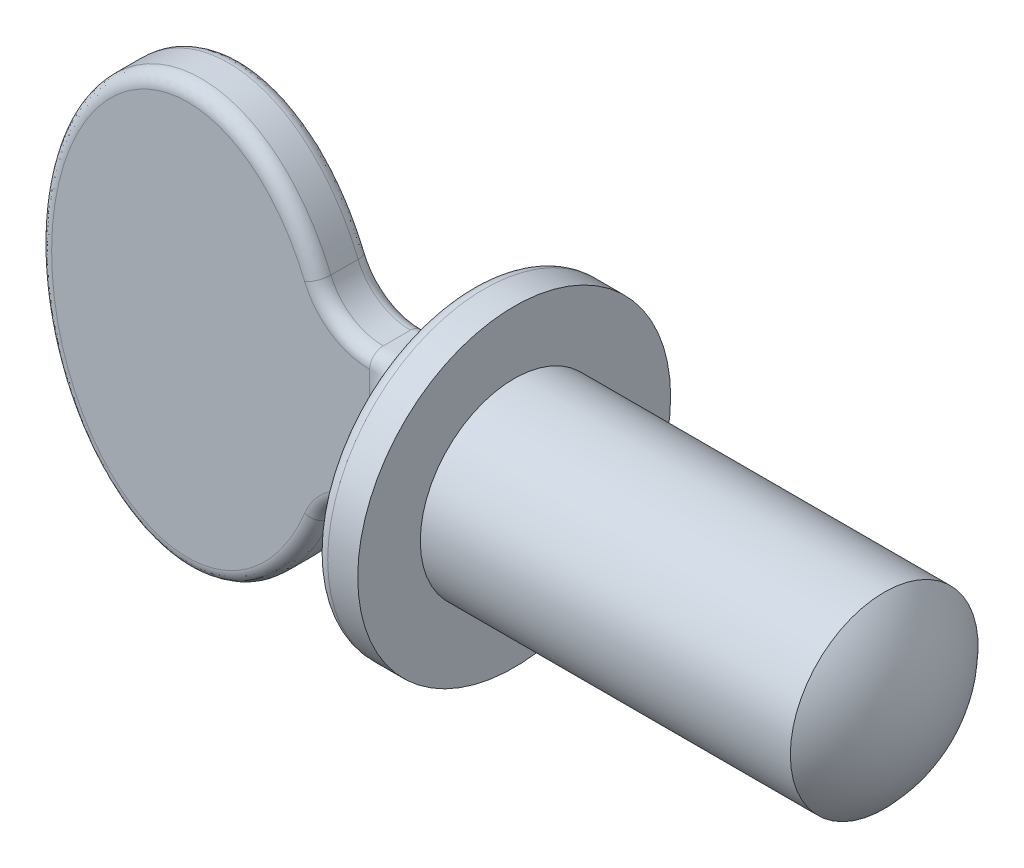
ISO-10303-21;
HEADER;
FILE_DESCRIPTION(('STEP AP214'),'2;1');
FILE_NAME('part.step','',(''),(''),'','','');
FILE_SCHEMA(('AUTOMOTIVE_DESIGN { 1 0 10303 214 1 1 1 1 }'));
ENDSEC;
DATA;
#1=APPLICATION_CONTEXT('core data for automotive mechanical design processes');
#2=APPLICATION_PROTOCOL_DEFINITION('international standard','automotive_design',2000,#1);
#3=PRODUCT_CONTEXT('',#1,'mechanical');
#4=PRODUCT('Part','Part','',(#3));
#5=PRODUCT_RELATED_PRODUCT_CATEGORY('part','',(#4));
#6=PRODUCT_DEFINITION_FORMATION('','',#4);
#7=PRODUCT_DEFINITION_CONTEXT('part definition',#1,'design');
#8=PRODUCT_DEFINITION('design','',#6,#7);
#9=PRODUCT_DEFINITION_SHAPE('','',#8);
#10=(LENGTH_UNIT() NAMED_UNIT(*) SI_UNIT(.MILLI.,.METRE.));
#11=(NAMED_UNIT(*) PLANE_ANGLE_UNIT() SI_UNIT($,.RADIAN.));
#12=(NAMED_UNIT(*) SI_UNIT($,.STERADIAN.) SOLID_ANGLE_UNIT());
#13=UNCERTAINTY_MEASURE_WITH_UNIT(LENGTH_MEASURE(1.E-05),#10,'distance_accuracy_value','');
#14=(GEOMETRIC_REPRESENTATION_CONTEXT(3) GLOBAL_UNCERTAINTY_ASSIGNED_CONTEXT((#13)) GLOBAL_UNIT_ASSIGNED_CONTEXT((#10,
#11,#12)) REPRESENTATION_CONTEXT('',''));
#15=CARTESIAN_POINT('',(0.,0.,0.));
#16=DIRECTION('',(0.,0.,1.));
#17=DIRECTION('',(1.,0.,0.));
#18=AXIS2_PLACEMENT_3D('',#15,#16,#17);
#19=CARTESIAN_POINT('',(3.39763741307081,-2.36920294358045,0.508));
#20=DIRECTION('',(0.,0.,-1.));
#21=DIRECTION('',(-1.,0.,0.));
#22=AXIS2_PLACEMENT_3D('',#19,#20,#21);
#23=CYLINDRICAL_SURFACE('',#22,1.05686961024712);
#24=DIRECTION('',(0.,0.,-1.));
#25=VECTOR('',#24,1.);
#26=CARTESIAN_POINT('',(2.41967497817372,-1.9685,0.508));
#27=LINE('',#26,#25);
#28=CARTESIAN_POINT('',(2.41967497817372,-1.9685,0.254));
#29=VERTEX_POINT('',#28);
#30=CARTESIAN_POINT('',(2.41967497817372,-1.9685,-0.254));
#31=VERTEX_POINT('',#30);
#32=EDGE_CURVE('E417',#29,#31,#27,.T.);
#33=ORIENTED_EDGE('',*,*,#32,.T.);
#34=CARTESIAN_POINT('',(3.39763741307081,-2.36920294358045,-0.254));
#35=DIRECTION('',(0.,0.,1.));
#36=DIRECTION('',(1.,0.,0.));
#37=AXIS2_PLACEMENT_3D('',#34,#35,#36);
#38=CIRCLE('',#37,1.05686961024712);
#39=CARTESIAN_POINT('',(3.39763741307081,-1.31233333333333,-0.254));
#40=VERTEX_POINT('',#39);
#41=EDGE_CURVE('E688',#31,#40,#38,.F.);
#42=ORIENTED_EDGE('',*,*,#41,.T.);
#43=DIRECTION('',(0.,0.,-1.));
#44=VECTOR('',#43,1.);
#45=CARTESIAN_POINT('',(3.39763741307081,-1.31233333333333,0.508));
#46=LINE('',#45,#44);
#47=CARTESIAN_POINT('',(3.39763741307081,-1.31233333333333,0.254));
#48=VERTEX_POINT('',#47);
#49=EDGE_CURVE('E350',#48,#40,#46,.T.);
#50=ORIENTED_EDGE('',*,*,#49,.F.);
#51=CARTESIAN_POINT('',(3.39763741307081,-2.36920294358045,0.254));
#52=DIRECTION('',(0.,0.,1.));
#53=DIRECTION('',(1.,0.,0.));
#54=AXIS2_PLACEMENT_3D('',#51,#52,#53);
#55=CIRCLE('',#54,1.05686961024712);
#56=EDGE_CURVE('E687',#48,#29,#55,.T.);
#57=ORIENTED_EDGE('',*,*,#56,.T.);
#58=EDGE_LOOP('',(#33,#42,#50,#57));
#59=FACE_BOUND('',#58,.T.);
#60=ADVANCED_FACE('F255',(#59),#23,.F.);
#61=CARTESIAN_POINT('',(3.39763741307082,2.36920294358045,0.508));
#62=DIRECTION('',(0.,0.,-1.));
#63=DIRECTION('',(-1.,0.,0.));
#64=AXIS2_PLACEMENT_3D('',#61,#62,#63);
#65=CYLINDRICAL_SURFACE('',#64,1.05686961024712);
#66=DIRECTION('',(0.,0.,-1.));
#67=VECTOR('',#66,1.);
#68=CARTESIAN_POINT('',(3.39763741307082,1.31233333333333,0.508));
#69=LINE('',#68,#67);
#70=CARTESIAN_POINT('',(3.39763741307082,1.31233333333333,0.254));
#71=VERTEX_POINT('',#70);
#72=CARTESIAN_POINT('',(3.39763741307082,1.31233333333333,-0.254));
#73=VERTEX_POINT('',#72);
#74=EDGE_CURVE('E599',#71,#73,#69,.T.);
#75=ORIENTED_EDGE('',*,*,#74,.T.);
#76=CARTESIAN_POINT('',(3.39763741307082,2.36920294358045,-0.254));
#77=DIRECTION('',(0.,0.,1.));
#78=DIRECTION('',(1.,0.,0.));
#79=AXIS2_PLACEMENT_3D('',#76,#77,#78);
#80=CIRCLE('',#79,1.05686961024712);
#81=CARTESIAN_POINT('',(2.41967497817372,1.9685,-0.254));
#82=VERTEX_POINT('',#81);
#83=EDGE_CURVE('E532',#73,#82,#80,.F.);
#84=ORIENTED_EDGE('',*,*,#83,.T.);
#85=DIRECTION('',(0.,0.,-1.));
#86=VECTOR('',#85,1.);
#87=CARTESIAN_POINT('',(2.41967497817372,1.9685,0.508));
#88=LINE('',#87,#86);
#89=CARTESIAN_POINT('',(2.41967497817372,1.9685,0.254));
#90=VERTEX_POINT('',#89);
#91=EDGE_CURVE('E597',#90,#82,#88,.T.);
#92=ORIENTED_EDGE('',*,*,#91,.F.);
#93=CARTESIAN_POINT('',(3.39763741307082,2.36920294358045,0.254));
#94=DIRECTION('',(0.,0.,1.));
#95=DIRECTION('',(1.,0.,0.));
#96=AXIS2_PLACEMENT_3D('',#93,#94,#95);
#97=CIRCLE('',#96,1.05686961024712);
#98=EDGE_CURVE('E525',#90,#71,#97,.T.);
#99=ORIENTED_EDGE('',*,*,#98,.T.);
#100=EDGE_LOOP('',(#75,#84,#92,#99));
#101=FACE_BOUND('',#100,.T.);
#102=ADVANCED_FACE('F424',(#101),#65,.F.);
#103=CARTESIAN_POINT('',(0.,0.,0.508));
#104=DIRECTION('',(0.,0.,1.));
#105=DIRECTION('',(0.,1.,0.));
#106=AXIS2_PLACEMENT_3D('',#103,#104,#105);
#107=ELLIPSE('',#106,3.937,2.794);
#108=DIRECTION('',(0.,0.,-1.));
#109=VECTOR('',#108,1.);
#110=SURFACE_OF_LINEAR_EXTRUSION('',#107,#109);
#111=ORIENTED_EDGE('',*,*,#91,.T.);
#112=CARTESIAN_POINT('',(-2.42953871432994,-1.06988650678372,-0.508));
#113=CARTESIAN_POINT('',(-2.67806308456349,-1.1223425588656,-0.508));
#114=CARTESIAN_POINT('',(-2.67806308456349,-1.1223425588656,-0.254));
#115=CARTESIAN_POINT('',(-2.3813275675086,-1.29830917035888,-0.508));
#116=CARTESIAN_POINT('',(-2.62738331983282,-1.36245895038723,-0.508));
#117=CARTESIAN_POINT('',(-2.62738331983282,-1.36245895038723,-0.254));
#118=CARTESIAN_POINT('',(-2.31706517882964,-1.52335296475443,-0.508));
#119=CARTESIAN_POINT('',(-2.55974244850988,-1.59951584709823,-0.508));
#120=CARTESIAN_POINT('',(-2.55974244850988,-1.59951584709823,-0.254));
#121=CARTESIAN_POINT('',(-2.15402597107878,-1.9606753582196,-0.508));
#122=CARTESIAN_POINT('',(-2.38735395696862,-2.06194694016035,-0.508));
#123=CARTESIAN_POINT('',(-2.38735395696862,-2.06194694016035,-0.254));
#124=CARTESIAN_POINT('',(-2.05530031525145,-2.17297233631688,-0.508));
#125=CARTESIAN_POINT('',(-2.28266133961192,-2.28733788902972,-0.508));
#126=CARTESIAN_POINT('',(-2.28266133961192,-2.28733788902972,-0.254));
#127=CARTESIAN_POINT('',(-1.8565056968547,-2.51319514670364,-0.508));
#128=CARTESIAN_POINT('',(-2.07025578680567,-2.65084271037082,-0.508));
#129=CARTESIAN_POINT('',(-2.07025578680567,-2.65084271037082,-0.254));
#130=CARTESIAN_POINT('',(-1.76631603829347,-2.64689289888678,-0.508));
#131=CARTESIAN_POINT('',(-1.97351333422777,-2.79437306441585,-0.508));
#132=CARTESIAN_POINT('',(-1.97351333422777,-2.79437306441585,-0.254));
#133=CARTESIAN_POINT('',(-1.56670354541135,-2.89917346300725,-0.508));
#134=CARTESIAN_POINT('',(-1.75790917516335,-3.06687436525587,-0.508));
#135=CARTESIAN_POINT('',(-1.75790917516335,-3.06687436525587,-0.254));
#136=CARTESIAN_POINT('',(-1.45730856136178,-3.01777773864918,-0.508));
#137=CARTESIAN_POINT('',(-1.63907948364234,-3.19586595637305,-0.508));
#138=CARTESIAN_POINT('',(-1.63907948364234,-3.19586595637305,-0.254));
#139=CARTESIAN_POINT('',(-1.24726681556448,-3.20759724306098,-0.508));
#140=CARTESIAN_POINT('',(-1.40883959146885,-3.40393298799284,-0.508));
#141=CARTESIAN_POINT('',(-1.40883959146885,-3.40393298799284,-0.254));
#142=CARTESIAN_POINT('',(-1.15075559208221,-3.28336841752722,-0.508));
#143=CARTESIAN_POINT('',(-1.30241841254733,-3.48757627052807,-0.508));
#144=CARTESIAN_POINT('',(-1.30241841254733,-3.48757627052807,-0.254));
#145=CARTESIAN_POINT('',(-0.946803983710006,-3.41849479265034,-0.508));
#146=CARTESIAN_POINT('',(-1.07576597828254,-3.63774144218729,-0.508));
#147=CARTESIAN_POINT('',(-1.07576597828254,-3.63774144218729,-0.254));
#148=CARTESIAN_POINT('',(-0.839378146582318,-3.47787146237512,-0.508));
#149=CARTESIAN_POINT('',(-0.955553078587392,-3.70428571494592,-0.508));
#150=CARTESIAN_POINT('',(-0.955553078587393,-3.70428571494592,-0.254));
#151=CARTESIAN_POINT('',(-0.633843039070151,-3.56789218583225,-0.508));
#152=CARTESIAN_POINT('',(-0.723818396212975,-3.80577636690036,-0.508));
#153=CARTESIAN_POINT('',(-0.723818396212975,-3.80577636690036,-0.254));
#154=CARTESIAN_POINT('',(-0.537108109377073,-3.60165598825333,-0.508));
#155=CARTESIAN_POINT('',(-0.614119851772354,-3.84411987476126,-0.508));
#156=CARTESIAN_POINT('',(-0.614119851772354,-3.84411987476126,-0.254));
#157=CARTESIAN_POINT('',(-0.339331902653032,-3.65248383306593,-0.508));
#158=CARTESIAN_POINT('',(-0.388801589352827,-3.90202243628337,-0.508));
#159=CARTESIAN_POINT('',(-0.388801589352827,-3.90202243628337,-0.254));
#160=CARTESIAN_POINT('',(-0.238293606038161,-3.66955924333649,-0.508));
#161=CARTESIAN_POINT('',(-0.27318595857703,-3.92159427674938,-0.508));
#162=CARTESIAN_POINT('',(-0.27318595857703,-3.92159427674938,-0.254));
#163=CARTESIAN_POINT('',(-0.034475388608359,-3.68567445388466,-0.508));
#164=CARTESIAN_POINT('',(-0.0395873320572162,-3.94006182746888,-0.508));
#165=CARTESIAN_POINT('',(-0.0395873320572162,-3.94006182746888,-0.254));
#166=CARTESIAN_POINT('',(0.0683086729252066,-3.68466274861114,-0.508));
#167=CARTESIAN_POINT('',(0.0784014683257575,-3.9388984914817,-0.508));
#168=CARTESIAN_POINT('',(0.0784014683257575,-3.9388984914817,-0.254));
#169=CARTESIAN_POINT('',(0.272088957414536,-3.66456417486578,-0.508));
#170=CARTESIAN_POINT('',(0.311869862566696,-3.91587428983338,-0.508));
#171=CARTESIAN_POINT('',(0.311869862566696,-3.91587428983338,-0.254));
#172=CARTESIAN_POINT('',(0.37308473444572,-3.64547286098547,-0.508));
#173=CARTESIAN_POINT('',(0.427348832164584,-3.89400833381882,-0.508));
#174=CARTESIAN_POINT('',(0.427348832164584,-3.89400833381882,-0.254));
#175=CARTESIAN_POINT('',(0.566584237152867,-3.5918099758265,-0.508));
#176=CARTESIAN_POINT('',(0.647572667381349,-3.83293861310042,-0.508));
#177=CARTESIAN_POINT('',(0.64757266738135,-3.83293861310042,-0.254));
#178=CARTESIAN_POINT('',(0.659265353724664,-3.5578663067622,-0.508));
#179=CARTESIAN_POINT('',(0.752560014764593,-3.79443882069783,-0.508));
#180=CARTESIAN_POINT('',(0.752560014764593,-3.79443882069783,-0.254));
#181=CARTESIAN_POINT('',(0.838615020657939,-3.47679355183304,-0.508));
#182=CARTESIAN_POINT('',(0.954592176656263,-3.70311336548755,-0.508));
#183=CARTESIAN_POINT('',(0.954592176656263,-3.70311336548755,-0.254));
#184=CARTESIAN_POINT('',(0.92528108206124,-3.42965904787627,-0.508));
#185=CARTESIAN_POINT('',(1.0516337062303,-3.65028181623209,-0.508));
#186=CARTESIAN_POINT('',(1.0516337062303,-3.65028181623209,-0.254));
#187=CARTESIAN_POINT('',(1.12953179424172,-3.30045366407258,-0.508));
#188=CARTESIAN_POINT('',(1.2790425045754,-3.50643406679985,-0.508));
#189=CARTESIAN_POINT('',(1.2790425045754,-3.50643406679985,-0.254));
#190=CARTESIAN_POINT('',(1.24323792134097,-3.21224549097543,-0.508));
#191=CARTESIAN_POINT('',(1.40447787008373,-3.40898221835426,-0.508));
#192=CARTESIAN_POINT('',(1.40447787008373,-3.40898221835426,-0.254));
#193=CARTESIAN_POINT('',(1.45504675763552,-3.01870052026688,-0.508));
#194=CARTESIAN_POINT('',(1.63653892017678,-3.19692872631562,-0.508));
#195=CARTESIAN_POINT('',(1.63653892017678,-3.19692872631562,-0.254));
#196=CARTESIAN_POINT('',(1.55311138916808,-2.91332314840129,-0.508));
#197=CARTESIAN_POINT('',(1.74311876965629,-3.08228651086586,-0.508));
#198=CARTESIAN_POINT('',(1.74311876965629,-3.08228651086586,-0.254));
#199=CARTESIAN_POINT('',(1.7567819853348,-2.66196868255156,-0.508));
#200=CARTESIAN_POINT('',(1.96332488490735,-2.8105282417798,-0.508));
#201=CARTESIAN_POINT('',(1.96332488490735,-2.8105282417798,-0.254));
#202=CARTESIAN_POINT('',(1.85800944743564,-2.51246781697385,-0.508));
#203=CARTESIAN_POINT('',(2.071901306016,-2.6500079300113,-0.508));
#204=CARTESIAN_POINT('',(2.071901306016,-2.6500079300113,-0.254));
#205=CARTESIAN_POINT('',(2.03785333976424,-2.20076254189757,-0.508));
#206=CARTESIAN_POINT('',(2.26397611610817,-2.31709468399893,-0.508));
#207=CARTESIAN_POINT('',(2.26397611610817,-2.31709468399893,-0.254));
#208=CARTESIAN_POINT('',(2.11647846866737,-2.03856305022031,-0.508));
#209=CARTESIAN_POINT('',(2.34748415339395,-2.1447063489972,-0.508));
#210=CARTESIAN_POINT('',(2.34748415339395,-2.1447063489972,-0.254));
#211=CARTESIAN_POINT('',(2.22461915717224,-1.7746150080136,-0.508));
#212=CARTESIAN_POINT('',(2.46201925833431,-1.8651443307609,-0.508));
#213=CARTESIAN_POINT('',(2.46201925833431,-1.8651443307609,-0.254));
#214=CARTESIAN_POINT('',(2.2609989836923,-1.67559877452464,-0.508));
#215=CARTESIAN_POINT('',(2.50046981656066,-1.7604750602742,-0.508));
#216=CARTESIAN_POINT('',(2.50046981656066,-1.7604750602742,-0.254));
#217=CARTESIAN_POINT('',(2.32683156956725,-1.47533598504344,-0.508));
#218=CARTESIAN_POINT('',(2.56995291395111,-1.54910644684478,-0.508));
#219=CARTESIAN_POINT('',(2.56995291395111,-1.54910644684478,-0.254));
#220=CARTESIAN_POINT('',(2.35628633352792,-1.37409008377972,-0.508));
#221=CARTESIAN_POINT('',(2.60098759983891,-1.44240770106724,-0.508));
#222=CARTESIAN_POINT('',(2.60098759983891,-1.44240770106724,-0.254));
#223=CARTESIAN_POINT('',(2.45282237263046,-0.99672785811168,-0.508));
#224=CARTESIAN_POINT('',(2.70261039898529,-1.04518135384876,-0.508));
#225=CARTESIAN_POINT('',(2.70261039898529,-1.04518135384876,-0.254));
#226=CARTESIAN_POINT('',(2.49907252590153,-0.715044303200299,-0.508));
#227=CARTESIAN_POINT('',(2.75109525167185,-0.749565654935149,-0.508));
#228=CARTESIAN_POINT('',(2.75109525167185,-0.749565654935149,-0.254));
#229=CARTESIAN_POINT('',(2.54567248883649,-0.147495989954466,-0.508));
#230=CARTESIAN_POINT('',(2.79994937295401,-0.154504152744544,-0.508));
#231=CARTESIAN_POINT('',(2.79994937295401,-0.154504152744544,-0.254));
#232=CARTESIAN_POINT('',(2.54590842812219,0.13837739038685,-0.508));
#233=CARTESIAN_POINT('',(2.80019927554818,0.14494931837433,-0.508));
#234=CARTESIAN_POINT('',(2.80019927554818,0.14494931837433,-0.254));
#235=CARTESIAN_POINT('',(2.50314262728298,0.670744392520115,-0.508));
#236=CARTESIAN_POINT('',(2.75536014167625,0.703113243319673,-0.508));
#237=CARTESIAN_POINT('',(2.75536014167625,0.703113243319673,-0.254));
#238=CARTESIAN_POINT('',(2.46556625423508,0.917675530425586,-0.508));
#239=CARTESIAN_POINT('',(2.71596009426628,0.962218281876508,-0.508));
#240=CARTESIAN_POINT('',(2.71596009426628,0.962218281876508,-0.254));
#241=CARTESIAN_POINT('',(2.35351407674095,1.40317160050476,-0.508));
#242=CARTESIAN_POINT('',(2.59810919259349,1.47286514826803,-0.508));
#243=CARTESIAN_POINT('',(2.59810919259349,1.47286514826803,-0.254));
#244=CARTESIAN_POINT('',(2.27905720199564,1.64174075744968,-0.508));
#245=CARTESIAN_POINT('',(2.51967837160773,1.72441078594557,-0.508));
#246=CARTESIAN_POINT('',(2.51967837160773,1.72441078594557,-0.254));
#247=CARTESIAN_POINT('',(2.10296943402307,2.07153806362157,-0.508));
#248=CARTESIAN_POINT('',(2.3331744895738,2.1796311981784,-0.508));
#249=CARTESIAN_POINT('',(2.3331744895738,2.1796311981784,-0.254));
#250=CARTESIAN_POINT('',(2.00636516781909,2.26480890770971,-0.508));
#251=CARTESIAN_POINT('',(2.23053377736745,2.38518362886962,-0.508));
#252=CARTESIAN_POINT('',(2.23053377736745,2.38518362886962,-0.254));
#253=CARTESIAN_POINT('',(1.78047465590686,2.63124667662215,-0.508));
#254=CARTESIAN_POINT('',(1.98878457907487,2.77737954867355,-0.508));
#255=CARTESIAN_POINT('',(1.98878457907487,2.77737954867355,-0.254));
#256=CARTESIAN_POINT('',(1.65129083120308,2.80447416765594,-0.508));
#257=CARTESIAN_POINT('',(1.84979032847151,2.96407977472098,-0.508));
#258=CARTESIAN_POINT('',(1.84979032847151,2.96407977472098,-0.254));
#259=CARTESIAN_POINT('',(1.41779860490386,3.05444647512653,-0.508));
#260=CARTESIAN_POINT('',(1.59578914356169,3.23598875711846,-0.508));
#261=CARTESIAN_POINT('',(1.5957891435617,3.23598875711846,-0.254));
#262=CARTESIAN_POINT('',(1.32477852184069,3.14175732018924,-0.508));
#263=CARTESIAN_POINT('',(1.49405856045,3.3315693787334,-0.508));
#264=CARTESIAN_POINT('',(1.49405856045,3.3315693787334,-0.254));
#265=CARTESIAN_POINT('',(1.1264653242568,3.3011914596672,-0.508));
#266=CARTESIAN_POINT('',(1.27551873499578,3.50726804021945,-0.508));
#267=CARTESIAN_POINT('',(1.27551873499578,3.50726804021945,-0.254));
#268=CARTESIAN_POINT('',(1.02118853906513,3.37333460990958,-0.508));
#269=CARTESIAN_POINT('',(1.15872953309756,3.58740628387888,-0.508));
#270=CARTESIAN_POINT('',(1.15872953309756,3.58740628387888,-0.254));
#271=CARTESIAN_POINT('',(0.817330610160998,3.48785914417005,-0.508));
#272=CARTESIAN_POINT('',(0.930720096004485,3.71549348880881,-0.508));
#273=CARTESIAN_POINT('',(0.930720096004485,3.71549348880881,-0.254));
#274=CARTESIAN_POINT('',(0.720402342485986,3.53316262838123,-0.508));
#275=CARTESIAN_POINT('',(0.821632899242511,3.76654812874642,-0.508));
#276=CARTESIAN_POINT('',(0.821632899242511,3.76654812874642,-0.254));
#277=CARTESIAN_POINT('',(0.520328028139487,3.60703504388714,-0.508));
#278=CARTESIAN_POINT('',(0.595089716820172,3.8501899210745,-0.508));
#279=CARTESIAN_POINT('',(0.595089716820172,3.8501899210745,-0.254));
#280=CARTESIAN_POINT('',(0.417186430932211,3.63561579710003,-0.508));
#281=CARTESIAN_POINT('',(0.477639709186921,3.88279011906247,-0.508));
#282=CARTESIAN_POINT('',(0.477639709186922,3.88279011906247,-0.254));
#283=CARTESIAN_POINT('',(0.206818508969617,3.67387815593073,-0.508));
#284=CARTESIAN_POINT('',(0.237206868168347,3.92651558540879,-0.508));
#285=CARTESIAN_POINT('',(0.237206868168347,3.92651558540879,-0.254));
#286=CARTESIAN_POINT('',(0.0995732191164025,3.68345742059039,-0.508));
#287=CARTESIAN_POINT('',(0.114197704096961,3.9375245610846,-0.508));
#288=CARTESIAN_POINT('',(0.114197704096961,3.9375245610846,-0.254));
#289=CARTESIAN_POINT('',(-0.114821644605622,3.68250895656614,-0.508));
#290=CARTESIAN_POINT('',(-0.131686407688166,3.93643687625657,-0.508));
#291=CARTESIAN_POINT('',(-0.131686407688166,3.93643687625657,-0.254));
#292=CARTESIAN_POINT('',(-0.221971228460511,3.67198365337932,-0.508));
#293=CARTESIAN_POINT('',(-0.254561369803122,3.92434300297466,-0.508));
#294=CARTESIAN_POINT('',(-0.254561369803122,3.92434300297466,-0.254));
#295=CARTESIAN_POINT('',(-0.42340487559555,3.6335702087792,-0.508));
#296=CARTESIAN_POINT('',(-0.484708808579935,3.88045959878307,-0.508));
#297=CARTESIAN_POINT('',(-0.484708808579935,3.88045959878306,-0.254));
#298=CARTESIAN_POINT('',(-0.51799937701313,3.60726509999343,-0.508));
#299=CARTESIAN_POINT('',(-0.592410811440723,3.85046695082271,-0.508));
#300=CARTESIAN_POINT('',(-0.592410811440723,3.85046695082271,-0.254));
#301=CARTESIAN_POINT('',(-0.702018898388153,3.54051420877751,-0.508));
#302=CARTESIAN_POINT('',(-0.800855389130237,3.77485728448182,-0.508));
#303=CARTESIAN_POINT('',(-0.800855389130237,3.77485728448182,-0.254));
#304=CARTESIAN_POINT('',(-0.79144178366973,3.5000626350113,-0.508));
#305=CARTESIAN_POINT('',(-0.901595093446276,3.72923386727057,-0.508));
#306=CARTESIAN_POINT('',(-0.901595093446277,3.72923386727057,-0.254));
#307=CARTESIAN_POINT('',(-0.995772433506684,3.38993421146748,-0.508));
#308=CARTESIAN_POINT('',(-1.13047031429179,3.6058828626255,-0.508));
#309=CARTESIAN_POINT('',(-1.13047031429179,3.6058828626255,-0.254));
#310=CARTESIAN_POINT('',(-1.10783636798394,3.31498239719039,-0.508));
#311=CARTESIAN_POINT('',(-1.25491481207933,3.52252387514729,-0.508));
#312=CARTESIAN_POINT('',(-1.25491481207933,3.52252387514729,-0.254));
#313=CARTESIAN_POINT('',(-1.31837395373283,3.14796333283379,-0.508));
#314=CARTESIAN_POINT('',(-1.48706802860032,3.33835616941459,-0.508));
#315=CARTESIAN_POINT('',(-1.48706802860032,3.33835616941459,-0.254));
#316=CARTESIAN_POINT('',(-1.41681992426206,3.05586208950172,-0.508));
#317=CARTESIAN_POINT('',(-1.5947427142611,3.23751282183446,-0.508));
#318=CARTESIAN_POINT('',(-1.5947427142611,3.23751282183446,-0.254));
#319=CARTESIAN_POINT('',(-1.63609804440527,2.82020806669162,-0.508));
#320=CARTESIAN_POINT('',(-1.83323646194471,2.98121697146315,-0.508));
#321=CARTESIAN_POINT('',(-1.83323646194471,2.98121697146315,-0.254));
#322=CARTESIAN_POINT('',(-1.75048386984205,2.67067473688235,-0.508));
#323=CARTESIAN_POINT('',(-1.95647717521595,2.81989583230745,-0.508));
#324=CARTESIAN_POINT('',(-1.95647717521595,2.81989583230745,-0.254));
#325=CARTESIAN_POINT('',(-1.95420988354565,2.35553788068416,-0.508));
#326=CARTESIAN_POINT('',(-2.17485567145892,2.48207587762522,-0.508));
#327=CARTESIAN_POINT('',(-2.17485567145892,2.48207587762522,-0.254));
#328=CARTESIAN_POINT('',(-2.04350621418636,2.18990688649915,-0.508));
#329=CARTESIAN_POINT('',(-2.26994425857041,2.30555118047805,-0.508));
#330=CARTESIAN_POINT('',(-2.26994425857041,2.30555118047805,-0.254));
#331=CARTESIAN_POINT('',(-2.2288280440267,1.78241164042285,-0.508));
#332=CARTESIAN_POINT('',(-2.46665332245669,1.87302961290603,-0.508));
#333=CARTESIAN_POINT('',(-2.46665332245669,1.87302961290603,-0.254));
#334=CARTESIAN_POINT('',(-2.31423979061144,1.53572223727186,-0.508));
#335=CARTESIAN_POINT('',(-2.55672789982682,1.61257271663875,-0.508));
#336=CARTESIAN_POINT('',(-2.55672789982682,1.61257271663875,-0.254));
#337=CARTESIAN_POINT('',(-2.44446639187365,1.03199799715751,-0.508));
#338=CARTESIAN_POINT('',(-2.69381177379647,1.08228449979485,-0.508));
#339=CARTESIAN_POINT('',(-2.69381177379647,1.08228449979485,-0.254));
#340=CARTESIAN_POINT('',(-2.48924065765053,0.774953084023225,-0.508));
#341=CARTESIAN_POINT('',(-2.7407780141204,0.8124440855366,-0.508));
#342=CARTESIAN_POINT('',(-2.7407780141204,0.8124440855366,-0.254));
#343=CARTESIAN_POINT('',(-2.54075598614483,0.251563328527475,-0.508));
#344=CARTESIAN_POINT('',(-2.79480168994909,0.263568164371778,-0.508));
#345=CARTESIAN_POINT('',(-2.79480168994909,0.263568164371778,-0.254));
#346=CARTESIAN_POINT('',(-2.54666205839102,-0.0148627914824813,-0.508));
#347=CARTESIAN_POINT('',(-2.80098296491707,-0.0155405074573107,-0.508));
#348=CARTESIAN_POINT('',(-2.80098296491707,-0.0155405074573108,-0.254));
#349=CARTESIAN_POINT('',(-2.51848120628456,-0.54561309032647,-0.508));
#350=CARTESIAN_POINT('',(-2.77144588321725,-0.571867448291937,-0.508));
#351=CARTESIAN_POINT('',(-2.77144588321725,-0.571867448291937,-0.254));
#352=CARTESIAN_POINT('',(-2.48440379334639,-0.809937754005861,-0.508));
#353=CARTESIAN_POINT('',(-2.73573749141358,-0.849086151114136,-0.508));
#354=CARTESIAN_POINT('',(-2.73573749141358,-0.849086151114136,-0.254));
#355=CARTESIAN_POINT('',(-2.42953871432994,-1.06988650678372,-0.508));
#356=CARTESIAN_POINT('',(-2.67806308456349,-1.1223425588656,-0.508));
#357=CARTESIAN_POINT('',(-2.67806308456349,-1.1223425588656,-0.254));
#358=(BOUNDED_SURFACE() B_SPLINE_SURFACE(3,2,((#112,#113,#114),(#115,#116,#117),(#118,#119,
#120),(#121,#122,#123),(#124,#125,#126),(#127,#128,#129),(#130,#131,#132),(#133,#134,#135),
(#136,#137,#138),(#139,#140,#141),(#142,#143,#144),(#145,#146,#147),(#148,#149,#150),(#151,#152,
#153),(#154,#155,#156),(#157,#158,#159),(#160,#161,#162),(#163,#164,#165),(#166,#167,#168),
(#169,#170,#171),(#172,#173,#174),(#175,#176,#177),(#178,#179,#180),(#181,#182,#183),(#184,#185,
#186),(#187,#188,#189),(#190,#191,#192),(#193,#194,#195),(#196,#197,#198),(#199,#200,#201),
(#202,#203,#204),(#205,#206,#207),(#208,#209,#210),(#211,#212,#213),(#214,#215,#216),(#217,#218,
#219),(#220,#221,#222),(#223,#224,#225),(#226,#227,#228),(#229,#230,#231),(#232,#233,#234),
(#235,#236,#237),(#238,#239,#240),(#241,#242,#243),(#244,#245,#246),(#247,#248,#249),(#250,#251,
#252),(#253,#254,#255),(#256,#257,#258),(#259,#260,#261),(#262,#263,#264),(#265,#266,#267),
(#268,#269,#270),(#271,#272,#273),(#274,#275,#276),(#277,#278,#279),(#280,#281,#282),(#283,#284,
#285),(#286,#287,#288),(#289,#290,#291),(#292,#293,#294),(#295,#296,#297),(#298,#299,#300),
(#301,#302,#303),(#304,#305,#306),(#307,#308,#309),(#310,#311,#312),(#313,#314,#315),(#316,#317,
#318),(#319,#320,#321),(#322,#323,#324),(#325,#326,#327),(#328,#329,#330),(#331,#332,#333),
(#334,#335,#336),(#337,#338,#339),(#340,#341,#342),(#343,#344,#345),(#346,#347,#348),(#349,#350,
#351),(#352,#353,#354),(#355,#356,#357)),.UNSPECIFIED.,.T.,.F.,
.F.) B_SPLINE_SURFACE_WITH_KNOTS((4,2,2,2,2,2,2,2,2,2,2,2,2,2,2,2,2,2,2,2,2,2,2,2,2,2,2,2,2,2,2,
2,2,2,2,2,2,2,2,2,4),(3,3),(0.,0.699735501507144,1.39843658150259,1.88081590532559,
2.36250140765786,2.7293120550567,3.09564005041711,3.401707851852,3.7075670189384,
4.01429730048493,4.32110302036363,4.61603131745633,4.91108093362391,5.34040544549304,
5.77075965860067,6.31008999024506,6.8492124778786,7.16544039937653,7.48157666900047,
8.33348152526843,9.18749454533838,9.93427445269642,10.680671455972,11.3262865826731,
11.9698968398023,12.3514499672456,12.7325004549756,13.052173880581,13.371621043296,
13.6927841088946,14.0139084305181,14.3072154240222,14.6006426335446,15.0028628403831,
15.405888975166,15.9675913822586,16.530269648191,17.3092934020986,18.0890943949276,
18.8855943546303,19.6819048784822),(0.,1.),
.UNSPECIFIED.) GEOMETRIC_REPRESENTATION_ITEM() RATIONAL_B_SPLINE_SURFACE(((1.,0.707106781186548,
1.),(1.,0.707106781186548,1.),(1.,0.707106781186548,1.),(1.,0.707106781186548,1.),(1.,
0.707106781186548,1.),(1.,0.707106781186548,1.),(1.,0.707106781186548,1.),(1.,0.707106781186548,
1.),(1.,0.707106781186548,1.),(1.,0.707106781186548,1.),(1.,0.707106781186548,1.),(1.,
0.707106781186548,1.),(1.,0.707106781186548,1.),(1.,0.707106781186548,1.),(1.,0.707106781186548,
1.),(1.,0.707106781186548,1.),(1.,0.707106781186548,1.),(1.,0.707106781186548,1.),(1.,
0.707106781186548,1.),(1.,0.707106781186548,1.),(1.,0.707106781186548,1.),(1.,0.707106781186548,
1.),(1.,0.707106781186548,1.),(1.,0.707106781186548,1.),(1.,0.707106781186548,1.),(1.,
0.707106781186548,1.),(1.,0.707106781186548,1.),(1.,0.707106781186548,1.),(1.,0.707106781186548,
1.),(1.,0.707106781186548,1.),(1.,0.707106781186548,1.),(1.,0.707106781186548,1.),(1.,
0.707106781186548,1.),(1.,0.707106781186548,1.),(1.,0.707106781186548,1.),(1.,0.707106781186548,
1.),(1.,0.707106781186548,1.),(1.,0.707106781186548,1.),(1.,0.707106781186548,1.),(1.,
0.707106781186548,1.),(1.,0.707106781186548,1.),(1.,0.707106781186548,1.),(1.,0.707106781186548,
1.),(1.,0.707106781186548,1.),(1.,0.707106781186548,1.),(1.,0.707106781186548,1.),(1.,
0.707106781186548,1.),(1.,0.707106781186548,1.),(1.,0.707106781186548,1.),(1.,0.707106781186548,
1.),(1.,0.707106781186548,1.),(1.,0.707106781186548,1.),(1.,0.707106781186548,1.),(1.,
0.707106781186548,1.),(1.,0.707106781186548,1.),(1.,0.707106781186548,1.),(1.,0.707106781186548,
1.),(1.,0.707106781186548,1.),(1.,0.707106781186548,1.),(1.,0.707106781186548,1.),(1.,
0.707106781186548,1.),(1.,0.707106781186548,1.),(1.,0.707106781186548,1.),(1.,0.707106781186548,
1.),(1.,0.707106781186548,1.),(1.,0.707106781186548,1.),(1.,0.707106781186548,1.),(1.,
0.707106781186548,1.),(1.,0.707106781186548,1.),(1.,0.707106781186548,1.),(1.,0.707106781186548,
1.),(1.,0.707106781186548,1.),(1.,0.707106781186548,1.),(1.,0.707106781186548,1.),(1.,
0.707106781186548,1.),(1.,0.707106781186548,1.),(1.,0.707106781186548,1.),(1.,0.707106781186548,
1.),(1.,0.707106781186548,1.),(1.,0.707106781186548,1.),(1.,0.707106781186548,1.),(1.,
0.707106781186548,1.))) REPRESENTATION_ITEM('') SURFACE());
#359=CARTESIAN_POINT('',(2.41967497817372,1.9685,-0.254));
#360=CARTESIAN_POINT('',(2.25031042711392,2.38542945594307,-0.254));
#361=CARTESIAN_POINT('',(2.00596675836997,2.79648158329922,-0.254));
#362=CARTESIAN_POINT('',(1.49799160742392,3.34093166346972,-0.254));
#363=CARTESIAN_POINT('',(1.27918524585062,3.52006526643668,-0.254));
#364=CARTESIAN_POINT('',(0.824519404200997,3.77487228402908,-0.254));
#365=CARTESIAN_POINT('',(0.595337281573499,3.86152000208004,-0.254));
#366=CARTESIAN_POINT('',(0.116274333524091,3.94837182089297,-0.254));
#367=CARTESIAN_POINT('',(-0.13388333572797,3.94714153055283,-0.254));
#368=CARTESIAN_POINT('',(-0.592713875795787,3.86005719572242,-0.254));
#369=CARTESIAN_POINT('',(-0.803064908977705,3.78232434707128,-0.254));
#370=CARTESIAN_POINT('',(-1.25884339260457,3.53671269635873,-0.254));
#371=CARTESIAN_POINT('',(-1.49225794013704,3.34730250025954,-0.254));
#372=CARTESIAN_POINT('',(-1.9688886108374,2.83590773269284,-0.254));
#373=CARTESIAN_POINT('',(-2.18567037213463,2.49073765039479,-0.254));
#374=CARTESIAN_POINT('',(-2.57946081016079,1.62514496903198,-0.254));
#375=CARTESIAN_POINT('',(-2.71380281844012,1.08646076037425,-0.254));
#376=CARTESIAN_POINT('',(-2.82215303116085,-0.0142692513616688,-0.254));
#377=CARTESIAN_POINT('',(-2.79328752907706,-0.576559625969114,-0.254));
#378=CARTESIAN_POINT('',(-2.57601895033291,-1.60569439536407,-0.254));
#379=CARTESIAN_POINT('',(-2.40624277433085,-2.07609930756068,-0.254));
#380=CARTESIAN_POINT('',(-1.98146625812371,-2.80261486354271,-0.254));
#381=CARTESIAN_POINT('',(-1.76650882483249,-3.08096180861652,-0.254));
#382=CARTESIAN_POINT('',(-1.30657381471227,-3.49615219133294,-0.254));
#383=CARTESIAN_POINT('',(-1.07838575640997,-3.65062001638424,-0.254));
#384=CARTESIAN_POINT('',(-0.61640980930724,-3.85270583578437,-0.254));
#385=CARTESIAN_POINT('',(-0.388253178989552,-3.91258803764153,-0.254));
#386=CARTESIAN_POINT('',(0.0769150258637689,-3.94918083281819,-0.254));
#387=CARTESIAN_POINT('',(0.313980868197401,-3.92525354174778,-0.254));
#388=CARTESIAN_POINT('',(0.753403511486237,-3.80377336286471,-0.254));
#389=CARTESIAN_POINT('',(0.956930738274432,-3.71016433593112,-0.254));
#390=CARTESIAN_POINT('',(1.40977740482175,-3.42376866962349,-0.254));
#391=CARTESIAN_POINT('',(1.64275523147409,-3.20589476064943,-0.254));
#392=CARTESIAN_POINT('',(2.03111441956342,-2.72710992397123,-0.254));
#393=CARTESIAN_POINT('',(2.18919790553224,-2.46823947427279,-0.254));
#394=CARTESIAN_POINT('',(2.35453247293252,-2.12142025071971,-0.254));
#395=CARTESIAN_POINT('',(2.38815642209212,-2.04532960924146,-0.254));
#396=CARTESIAN_POINT('',(2.41967497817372,-1.9685,-0.254));
#397=B_SPLINE_CURVE_WITH_KNOTS('',3,(#359,#360,#361,#362,#363,#364,#365,#366,#367,#368,#369,
#370,#371,#372,#373,#374,#375,#376,#377,#378,#379,#380,#381,#382,#383,#384,#385,#386,#387,#388,
#389,#390,#391,#392,#393,#394,#395,#396),.UNSPECIFIED.,.F.,.F.,(4,2,2,2,2,2,2,2,2,2,2,2,2,2,2,2,
2,2,4),(0.,1.37556453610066,2.21375379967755,2.93458248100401,3.66717955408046,4.32956836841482,
5.21483606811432,6.41718702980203,8.05393798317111,9.71959706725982,11.1947245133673,
12.2336794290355,13.0458946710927,13.740094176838,14.4395887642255,15.1022444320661,
16.0414723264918,16.9435917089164,17.1929672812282),.UNSPECIFIED.);
#398=EDGE_CURVE('E458',#82,#31,#397,.T.);
#399=ORIENTED_EDGE('',*,*,#398,.T.);
#400=ORIENTED_EDGE('',*,*,#32,.F.);
#401=CARTESIAN_POINT('',(-2.42953871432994,1.06988650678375,0.508));
#402=CARTESIAN_POINT('',(-2.67806308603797,1.12234255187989,0.508));
#403=CARTESIAN_POINT('',(-2.67806308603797,1.12234255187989,0.254));
#404=CARTESIAN_POINT('',(-2.38132756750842,1.29830917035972,0.508));
#405=CARTESIAN_POINT('',(-2.62738332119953,1.36245894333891,0.508));
#406=CARTESIAN_POINT('',(-2.62738332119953,1.36245894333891,0.254));
#407=CARTESIAN_POINT('',(-2.31706517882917,1.52335296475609,0.508));
#408=CARTESIAN_POINT('',(-2.55974244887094,1.59951584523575,0.508));
#409=CARTESIAN_POINT('',(-2.55974244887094,1.59951584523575,0.254));
#410=CARTESIAN_POINT('',(-2.15402597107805,1.96067535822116,0.508));
#411=CARTESIAN_POINT('',(-2.38735395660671,2.06194694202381,0.508));
#412=CARTESIAN_POINT('',(-2.38735395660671,2.06194694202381,0.254));
#413=CARTESIAN_POINT('',(-2.05530031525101,2.17297233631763,0.508));
#414=CARTESIAN_POINT('',(-2.28266133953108,2.28733788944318,0.508));
#415=CARTESIAN_POINT('',(-2.28266133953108,2.28733788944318,0.254));
#416=CARTESIAN_POINT('',(-1.8565056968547,2.51319514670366,0.508));
#417=CARTESIAN_POINT('',(-2.07025578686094,2.65084271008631,0.508));
#418=CARTESIAN_POINT('',(-2.07025578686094,2.65084271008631,0.254));
#419=CARTESIAN_POINT('',(-1.76631603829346,2.64689289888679,0.508));
#420=CARTESIAN_POINT('',(-1.97351333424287,2.7943730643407,0.508));
#421=CARTESIAN_POINT('',(-1.97351333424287,2.7943730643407,0.254));
#422=CARTESIAN_POINT('',(-1.56670354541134,2.89917346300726,0.508));
#423=CARTESIAN_POINT('',(-1.75790917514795,3.06687436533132,0.508));
#424=CARTESIAN_POINT('',(-1.75790917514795,3.06687436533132,0.254));
#425=CARTESIAN_POINT('',(-1.45730856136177,3.01777773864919,0.508));
#426=CARTESIAN_POINT('',(-1.63907948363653,3.1958659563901,0.508));
#427=CARTESIAN_POINT('',(-1.63907948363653,3.1958659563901,0.254));
#428=CARTESIAN_POINT('',(-1.24726681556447,3.20759724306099,0.508));
#429=CARTESIAN_POINT('',(-1.40883959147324,3.4039329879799,0.508));
#430=CARTESIAN_POINT('',(-1.40883959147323,3.4039329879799,0.254));
#431=CARTESIAN_POINT('',(-1.1507555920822,3.28336841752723,0.508));
#432=CARTESIAN_POINT('',(-1.30241841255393,3.48757627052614,0.508));
#433=CARTESIAN_POINT('',(-1.30241841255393,3.48757627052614,0.254));
#434=CARTESIAN_POINT('',(-0.946803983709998,3.41849479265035,0.508));
#435=CARTESIAN_POINT('',(-1.07576597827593,3.63774144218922,0.508));
#436=CARTESIAN_POINT('',(-1.07576597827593,3.63774144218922,0.254));
#437=CARTESIAN_POINT('',(-0.83937814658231,3.47787146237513,0.508));
#438=CARTESIAN_POINT('',(-0.955553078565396,3.7042857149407,0.508));
#439=CARTESIAN_POINT('',(-0.955553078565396,3.7042857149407,0.254));
#440=CARTESIAN_POINT('',(-0.633843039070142,3.56789218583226,0.508));
#441=CARTESIAN_POINT('',(-0.723818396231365,3.80577636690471,0.508));
#442=CARTESIAN_POINT('',(-0.723818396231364,3.80577636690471,0.254));
#443=CARTESIAN_POINT('',(-0.537108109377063,3.60165598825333,0.508));
#444=CARTESIAN_POINT('',(-0.614119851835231,3.84411987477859,0.508));
#445=CARTESIAN_POINT('',(-0.614119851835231,3.84411987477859,0.254));
#446=CARTESIAN_POINT('',(-0.339331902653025,3.65248383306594,0.508));
#447=CARTESIAN_POINT('',(-0.388801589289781,3.90202243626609,0.508));
#448=CARTESIAN_POINT('',(-0.388801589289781,3.90202243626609,0.254));
#449=CARTESIAN_POINT('',(-0.238293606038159,3.6695592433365,0.508));
#450=CARTESIAN_POINT('',(-0.27318595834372,3.92159427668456,0.508));
#451=CARTESIAN_POINT('',(-0.27318595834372,3.92159427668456,0.254));
#452=CARTESIAN_POINT('',(-0.0344753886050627,3.68567445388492,0.508));
#453=CARTESIAN_POINT('',(-0.0395873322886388,3.94006182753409,0.508));
#454=CARTESIAN_POINT('',(-0.0395873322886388,3.94006182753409,0.254));
#455=CARTESIAN_POINT('',(0.0683086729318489,3.68466274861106,0.508));
#456=CARTESIAN_POINT('',(0.0784014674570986,3.93889849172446,0.508));
#457=CARTESIAN_POINT('',(0.0784014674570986,3.93889849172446,0.254));
#458=CARTESIAN_POINT('',(0.272088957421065,3.66456417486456,0.508));
#459=CARTESIAN_POINT('',(0.311869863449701,3.91587428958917,0.508));
#460=CARTESIAN_POINT('',(0.311869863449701,3.91587428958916,0.254));
#461=CARTESIAN_POINT('',(0.373084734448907,3.64547286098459,0.508));
#462=CARTESIAN_POINT('',(0.427348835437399,3.89400833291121,0.508));
#463=CARTESIAN_POINT('',(0.427348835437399,3.89400833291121,0.254));
#464=CARTESIAN_POINT('',(0.566584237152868,3.5918099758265,0.508));
#465=CARTESIAN_POINT('',(0.647572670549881,3.83293861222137,0.508));
#466=CARTESIAN_POINT('',(0.647572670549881,3.83293861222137,0.254));
#467=CARTESIAN_POINT('',(0.65926535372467,3.5578663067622,0.508));
#468=CARTESIAN_POINT('',(0.752560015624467,3.79443882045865,0.508));
#469=CARTESIAN_POINT('',(0.752560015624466,3.79443882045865,0.254));
#470=CARTESIAN_POINT('',(0.838615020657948,3.47679355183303,0.508));
#471=CARTESIAN_POINT('',(0.954592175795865,3.7031133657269,0.508));
#472=CARTESIAN_POINT('',(0.954592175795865,3.7031133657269,0.254));
#473=CARTESIAN_POINT('',(0.925281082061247,3.42965904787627,0.508));
#474=CARTESIAN_POINT('',(1.05163370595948,3.65028181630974,0.508));
#475=CARTESIAN_POINT('',(1.05163370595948,3.65028181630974,0.254));
#476=CARTESIAN_POINT('',(1.12953179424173,3.30045366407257,0.508));
#477=CARTESIAN_POINT('',(1.27904250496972,3.5064340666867,0.508));
#478=CARTESIAN_POINT('',(1.27904250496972,3.5064340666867,0.254));
#479=CARTESIAN_POINT('',(1.24323792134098,3.21224549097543,0.508));
#480=CARTESIAN_POINT('',(1.40447787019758,3.4089822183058,0.508));
#481=CARTESIAN_POINT('',(1.40447787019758,3.4089822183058,0.254));
#482=CARTESIAN_POINT('',(1.45504675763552,3.01870052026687,0.508));
#483=CARTESIAN_POINT('',(1.63653892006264,3.19692872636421,0.508));
#484=CARTESIAN_POINT('',(1.63653892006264,3.19692872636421,0.254));
#485=CARTESIAN_POINT('',(1.55311138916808,2.91332314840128,0.508));
#486=CARTESIAN_POINT('',(1.74311876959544,3.08228651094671,0.508));
#487=CARTESIAN_POINT('',(1.74311876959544,3.08228651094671,0.254));
#488=CARTESIAN_POINT('',(1.75678198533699,2.66196868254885,0.508));
#489=CARTESIAN_POINT('',(1.96332488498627,2.8105282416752,0.508));
#490=CARTESIAN_POINT('',(1.96332488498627,2.8105282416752,0.254));
#491=CARTESIAN_POINT('',(1.85800944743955,2.51246781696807,0.508));
#492=CARTESIAN_POINT('',(2.07190130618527,2.650007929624,0.508));
#493=CARTESIAN_POINT('',(2.07190130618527,2.650007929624,0.254));
#494=CARTESIAN_POINT('',(2.03785333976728,2.20076254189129,0.508));
#495=CARTESIAN_POINT('',(2.2639761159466,2.31709468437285,0.508));
#496=CARTESIAN_POINT('',(2.2639761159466,2.31709468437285,0.254));
#497=CARTESIAN_POINT('',(2.11647846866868,2.03856305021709,0.508));
#498=CARTESIAN_POINT('',(2.34748415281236,2.14470635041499,0.508));
#499=CARTESIAN_POINT('',(2.34748415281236,2.14470635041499,0.254));
#500=CARTESIAN_POINT('',(2.22461915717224,1.7746150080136,0.508));
#501=CARTESIAN_POINT('',(2.46201925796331,1.86514433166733,0.508));
#502=CARTESIAN_POINT('',(2.46201925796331,1.86514433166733,0.254));
#503=CARTESIAN_POINT('',(2.2609989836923,1.67559877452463,0.508));
#504=CARTESIAN_POINT('',(2.50046981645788,1.76047506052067,0.508));
#505=CARTESIAN_POINT('',(2.50046981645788,1.76047506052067,0.254));
#506=CARTESIAN_POINT('',(2.32683156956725,1.47533598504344,0.508));
#507=CARTESIAN_POINT('',(2.56995291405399,1.54910644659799,0.508));
#508=CARTESIAN_POINT('',(2.56995291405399,1.54910644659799,0.254));
#509=CARTESIAN_POINT('',(2.35628633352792,1.37409008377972,0.508));
#510=CARTESIAN_POINT('',(2.60098759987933,1.44240770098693,0.508));
#511=CARTESIAN_POINT('',(2.60098759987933,1.44240770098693,0.254));
#512=CARTESIAN_POINT('',(2.45282237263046,0.996727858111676,0.508));
#513=CARTESIAN_POINT('',(2.7026103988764,1.04518135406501,0.508));
#514=CARTESIAN_POINT('',(2.70261039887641,1.04518135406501,0.254));
#515=CARTESIAN_POINT('',(2.49907252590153,0.715044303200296,0.508));
#516=CARTESIAN_POINT('',(2.75109525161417,0.749565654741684,0.508));
#517=CARTESIAN_POINT('',(2.75109525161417,0.749565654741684,0.254));
#518=CARTESIAN_POINT('',(2.54567248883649,0.147495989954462,0.508));
#519=CARTESIAN_POINT('',(2.7999493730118,0.154504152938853,0.508));
#520=CARTESIAN_POINT('',(2.7999493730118,0.154504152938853,0.254));
#521=CARTESIAN_POINT('',(2.54590842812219,-0.138377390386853,0.508));
#522=CARTESIAN_POINT('',(2.80019927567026,-0.144949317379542,0.508));
#523=CARTESIAN_POINT('',(2.80019927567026,-0.144949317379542,0.254));
#524=CARTESIAN_POINT('',(2.50314262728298,-0.67074439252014,0.508));
#525=CARTESIAN_POINT('',(2.75536014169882,-0.703113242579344,0.508));
#526=CARTESIAN_POINT('',(2.75536014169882,-0.703113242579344,0.254));
#527=CARTESIAN_POINT('',(2.46556625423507,-0.917675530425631,0.508));
#528=CARTESIAN_POINT('',(2.71596009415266,-0.962218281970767,0.508));
#529=CARTESIAN_POINT('',(2.71596009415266,-0.962218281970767,0.254));
#530=CARTESIAN_POINT('',(2.35351407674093,-1.4031716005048,0.508));
#531=CARTESIAN_POINT('',(2.59810919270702,-1.47286514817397,0.508));
#532=CARTESIAN_POINT('',(2.59810919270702,-1.47286514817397,0.254));
#533=CARTESIAN_POINT('',(2.27905720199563,-1.6417407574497,0.508));
#534=CARTESIAN_POINT('',(2.51967837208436,-1.72441078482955,0.508));
#535=CARTESIAN_POINT('',(2.51967837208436,-1.72441078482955,0.254));
#536=CARTESIAN_POINT('',(2.10296943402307,-2.07153806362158,0.508));
#537=CARTESIAN_POINT('',(2.33317448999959,-2.17963119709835,0.508));
#538=CARTESIAN_POINT('',(2.33317448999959,-2.17963119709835,0.254));
#539=CARTESIAN_POINT('',(2.00636516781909,-2.26480890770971,0.508));
#540=CARTESIAN_POINT('',(2.23053377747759,-2.38518362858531,0.508));
#541=CARTESIAN_POINT('',(2.23053377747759,-2.38518362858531,0.254));
#542=CARTESIAN_POINT('',(1.78047465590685,-2.63124667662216,0.508));
#543=CARTESIAN_POINT('',(1.98878457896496,-2.77737954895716,0.508));
#544=CARTESIAN_POINT('',(1.98878457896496,-2.77737954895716,0.254));
#545=CARTESIAN_POINT('',(1.65129083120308,-2.80447416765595,0.508));
#546=CARTESIAN_POINT('',(1.84979032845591,-2.96407977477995,0.508));
#547=CARTESIAN_POINT('',(1.84979032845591,-2.96407977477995,0.254));
#548=CARTESIAN_POINT('',(1.41779860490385,-3.05444647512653,0.508));
#549=CARTESIAN_POINT('',(1.59578914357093,-3.23598875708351,0.508));
#550=CARTESIAN_POINT('',(1.59578914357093,-3.23598875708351,0.254));
#551=CARTESIAN_POINT('',(1.32477852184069,-3.14175732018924,0.508));
#552=CARTESIAN_POINT('',(1.49405856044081,-3.33156937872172,0.508));
#553=CARTESIAN_POINT('',(1.49405856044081,-3.33156937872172,0.254));
#554=CARTESIAN_POINT('',(1.12646532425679,-3.30119145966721,0.508));
#555=CARTESIAN_POINT('',(1.27551873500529,-3.50726804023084,0.508));
#556=CARTESIAN_POINT('',(1.27551873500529,-3.50726804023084,0.254));
#557=CARTESIAN_POINT('',(1.02118853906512,-3.37333460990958,0.508));
#558=CARTESIAN_POINT('',(1.15872953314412,-3.5874062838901,0.508));
#559=CARTESIAN_POINT('',(1.15872953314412,-3.5874062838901,0.254));
#560=CARTESIAN_POINT('',(0.817330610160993,-3.48785914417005,0.508));
#561=CARTESIAN_POINT('',(0.93072009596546,-3.71549348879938,0.508));
#562=CARTESIAN_POINT('',(0.93072009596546,-3.71549348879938,0.254));
#563=CARTESIAN_POINT('',(0.72040234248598,-3.53316262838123,0.508));
#564=CARTESIAN_POINT('',(0.821632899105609,-3.76654812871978,0.508));
#565=CARTESIAN_POINT('',(0.821632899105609,-3.76654812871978,0.254));
#566=CARTESIAN_POINT('',(0.520328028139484,-3.60703504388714,0.508));
#567=CARTESIAN_POINT('',(0.595089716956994,-3.85018992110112,0.508));
#568=CARTESIAN_POINT('',(0.595089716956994,-3.85018992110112,0.254));
#569=CARTESIAN_POINT('',(0.417186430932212,-3.63561579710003,0.508));
#570=CARTESIAN_POINT('',(0.47763970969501,-3.88279011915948,0.508));
#571=CARTESIAN_POINT('',(0.47763970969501,-3.88279011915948,0.254));
#572=CARTESIAN_POINT('',(0.206818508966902,-3.67387815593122,0.508));
#573=CARTESIAN_POINT('',(0.237206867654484,-3.92651558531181,0.508));
#574=CARTESIAN_POINT('',(0.237206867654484,-3.92651558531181,0.254));
#575=CARTESIAN_POINT('',(0.0995732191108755,-3.68345742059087,0.508));
#576=CARTESIAN_POINT('',(0.114197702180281,-3.93752456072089,0.508));
#577=CARTESIAN_POINT('',(0.114197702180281,-3.93752456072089,0.254));
#578=CARTESIAN_POINT('',(-0.114821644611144,-3.68250895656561,0.508));
#579=CARTESIAN_POINT('',(-0.131686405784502,-3.93643687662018,0.508));
#580=CARTESIAN_POINT('',(-0.131686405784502,-3.93643687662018,0.254));
#581=CARTESIAN_POINT('',(-0.221971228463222,-3.67198365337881,0.508));
#582=CARTESIAN_POINT('',(-0.254561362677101,-3.92434300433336,0.508));
#583=CARTESIAN_POINT('',(-0.254561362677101,-3.92434300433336,0.254));
#584=CARTESIAN_POINT('',(-0.423404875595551,-3.6335702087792,0.508));
#585=CARTESIAN_POINT('',(-0.484708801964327,-3.88045960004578,0.508));
#586=CARTESIAN_POINT('',(-0.484708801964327,-3.88045960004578,0.254));
#587=CARTESIAN_POINT('',(-0.517999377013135,-3.60726509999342,0.508));
#588=CARTESIAN_POINT('',(-0.59241080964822,-3.85046695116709,0.508));
#589=CARTESIAN_POINT('',(-0.59241080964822,-3.85046695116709,0.254));
#590=CARTESIAN_POINT('',(-0.702018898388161,-3.54051420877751,0.508));
#591=CARTESIAN_POINT('',(-0.800855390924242,-3.77485728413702,0.508));
#592=CARTESIAN_POINT('',(-0.800855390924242,-3.77485728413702,0.254));
#593=CARTESIAN_POINT('',(-0.791441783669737,-3.5000626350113,0.508));
#594=CARTESIAN_POINT('',(-0.901595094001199,-3.72923386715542,0.508));
#595=CARTESIAN_POINT('',(-0.901595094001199,-3.72923386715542,0.254));
#596=CARTESIAN_POINT('',(-0.99577243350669,-3.38993421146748,0.508));
#597=CARTESIAN_POINT('',(-1.13047031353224,-3.60588286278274,0.508));
#598=CARTESIAN_POINT('',(-1.13047031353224,-3.60588286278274,0.254));
#599=CARTESIAN_POINT('',(-1.10783636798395,-3.31498239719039,0.508));
#600=CARTESIAN_POINT('',(-1.25491481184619,-3.52252387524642,0.508));
#601=CARTESIAN_POINT('',(-1.25491481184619,-3.52252387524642,0.254));
#602=CARTESIAN_POINT('',(-1.31837395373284,-3.14796333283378,0.508));
#603=CARTESIAN_POINT('',(-1.48706802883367,-3.33835616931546,0.508));
#604=CARTESIAN_POINT('',(-1.48706802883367,-3.33835616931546,0.254));
#605=CARTESIAN_POINT('',(-1.41681992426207,-3.05586208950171,0.508));
#606=CARTESIAN_POINT('',(-1.59474271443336,-3.23751282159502,0.508));
#607=CARTESIAN_POINT('',(-1.59474271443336,-3.23751282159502,0.254));
#608=CARTESIAN_POINT('',(-1.63609804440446,-2.82020806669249,0.508));
#609=CARTESIAN_POINT('',(-1.83323646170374,-2.98121697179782,0.508));
#610=CARTESIAN_POINT('',(-1.83323646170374,-2.98121697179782,0.254));
#611=CARTESIAN_POINT('',(-1.75048386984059,-2.67067473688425,0.508));
#612=CARTESIAN_POINT('',(-1.95647717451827,-2.8198958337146,0.508));
#613=CARTESIAN_POINT('',(-1.95647717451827,-2.8198958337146,0.254));
#614=CARTESIAN_POINT('',(-1.95420988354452,-2.35553788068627,0.508));
#615=CARTESIAN_POINT('',(-2.1748556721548,-2.48207587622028,0.508));
#616=CARTESIAN_POINT('',(-2.1748556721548,-2.48207587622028,0.254));
#617=CARTESIAN_POINT('',(-2.04350621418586,-2.18990688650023,0.508));
#618=CARTESIAN_POINT('',(-2.2699442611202,-2.30555117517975,0.508));
#619=CARTESIAN_POINT('',(-2.26994426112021,-2.30555117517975,0.254));
#620=CARTESIAN_POINT('',(-2.22882804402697,-1.78241164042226,0.508));
#621=CARTESIAN_POINT('',(-2.46665332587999,-1.87302960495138,0.508));
#622=CARTESIAN_POINT('',(-2.46665332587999,-1.87302960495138,0.254));
#623=CARTESIAN_POINT('',(-2.31423979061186,-1.53572223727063,0.508));
#624=CARTESIAN_POINT('',(-2.55672790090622,-1.61257271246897,0.508));
#625=CARTESIAN_POINT('',(-2.55672790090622,-1.61257271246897,0.254));
#626=CARTESIAN_POINT('',(-2.44446639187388,-1.03199799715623,0.508));
#627=CARTESIAN_POINT('',(-2.69381177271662,-1.08228450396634,0.508));
#628=CARTESIAN_POINT('',(-2.69381177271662,-1.08228450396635,0.254));
#629=CARTESIAN_POINT('',(-2.48924065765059,-0.774953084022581,0.508));
#630=CARTESIAN_POINT('',(-2.74077801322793,-0.812444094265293,0.508));
#631=CARTESIAN_POINT('',(-2.74077801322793,-0.812444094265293,0.254));
#632=CARTESIAN_POINT('',(-2.54075598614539,-0.251563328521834,0.508));
#633=CARTESIAN_POINT('',(-2.79480168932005,-0.263568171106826,0.508));
#634=CARTESIAN_POINT('',(-2.79480168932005,-0.263568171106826,0.254));
#635=CARTESIAN_POINT('',(-2.54666205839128,0.0148627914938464,0.508));
#636=CARTESIAN_POINT('',(-2.80098296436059,0.0155405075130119,0.508));
#637=CARTESIAN_POINT('',(-2.80098296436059,0.0155405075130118,0.254));
#638=CARTESIAN_POINT('',(-2.51848120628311,0.545613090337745,0.508));
#639=CARTESIAN_POINT('',(-2.77144588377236,0.571867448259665,0.508));
#640=CARTESIAN_POINT('',(-2.77144588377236,0.571867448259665,0.254));
#641=CARTESIAN_POINT('',(-2.48440379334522,0.809937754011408,0.508));
#642=CARTESIAN_POINT('',(-2.73573749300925,0.849086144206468,0.508));
#643=CARTESIAN_POINT('',(-2.73573749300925,0.849086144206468,0.254));
#644=CARTESIAN_POINT('',(-2.42953871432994,1.06988650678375,0.508));
#645=CARTESIAN_POINT('',(-2.67806308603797,1.12234255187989,0.508));
#646=CARTESIAN_POINT('',(-2.67806308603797,1.12234255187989,0.254));
#647=(BOUNDED_SURFACE() B_SPLINE_SURFACE(3,2,((#401,#402,#403),(#404,#405,#406),(#407,#408,
#409),(#410,#411,#412),(#413,#414,#415),(#416,#417,#418),(#419,#420,#421),(#422,#423,#424),
(#425,#426,#427),(#428,#429,#430),(#431,#432,#433),(#434,#435,#436),(#437,#438,#439),(#440,#441,
#442),(#443,#444,#445),(#446,#447,#448),(#449,#450,#451),(#452,#453,#454),(#455,#456,#457),
(#458,#459,#460),(#461,#462,#463),(#464,#465,#466),(#467,#468,#469),(#470,#471,#472),(#473,#474,
#475),(#476,#477,#478),(#479,#480,#481),(#482,#483,#484),(#485,#486,#487),(#488,#489,#490),
(#491,#492,#493),(#494,#495,#496),(#497,#498,#499),(#500,#501,#502),(#503,#504,#505),(#506,#507,
#508),(#509,#510,#511),(#512,#513,#514),(#515,#516,#517),(#518,#519,#520),(#521,#522,#523),
(#524,#525,#526),(#527,#528,#529),(#530,#531,#532),(#533,#534,#535),(#536,#537,#538),(#539,#540,
#541),(#542,#543,#544),(#545,#546,#547),(#548,#549,#550),(#551,#552,#553),(#554,#555,#556),
(#557,#558,#559),(#560,#561,#562),(#563,#564,#565),(#566,#567,#568),(#569,#570,#571),(#572,#573,
#574),(#575,#576,#577),(#578,#579,#580),(#581,#582,#583),(#584,#585,#586),(#587,#588,#589),
(#590,#591,#592),(#593,#594,#595),(#596,#597,#598),(#599,#600,#601),(#602,#603,#604),(#605,#606,
#607),(#608,#609,#610),(#611,#612,#613),(#614,#615,#616),(#617,#618,#619),(#620,#621,#622),
(#623,#624,#625),(#626,#627,#628),(#629,#630,#631),(#632,#633,#634),(#635,#636,#637),(#638,#639,
#640),(#641,#642,#643),(#644,#645,#646)),.UNSPECIFIED.,.T.,.F.,
.F.) B_SPLINE_SURFACE_WITH_KNOTS((4,2,2,2,2,2,2,2,2,2,2,2,2,2,2,2,2,2,2,2,2,2,2,2,2,2,2,2,2,2,2,
2,2,2,2,2,2,2,2,2,4),(3,3),(0.,0.699735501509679,1.39843658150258,1.88081590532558,
2.36250140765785,2.72931205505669,3.0956400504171,3.40170785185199,3.70756701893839,
4.01429730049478,4.32110302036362,4.61603131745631,4.9110809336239,5.34040544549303,
5.77075965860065,6.31008999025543,6.84921247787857,7.16544039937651,7.48157666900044,
8.33348152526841,9.18749454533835,9.93427445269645,10.6806714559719,11.326286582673,
11.9698968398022,12.3514499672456,12.7325004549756,13.052173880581,13.371621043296,
13.6927841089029,14.013908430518,14.3072154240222,14.6006426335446,15.0028628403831,
15.405888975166,15.967591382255,16.530269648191,17.3092934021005,18.0890943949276,
18.8855943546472,19.6819048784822),(0.,1.),
.UNSPECIFIED.) GEOMETRIC_REPRESENTATION_ITEM() RATIONAL_B_SPLINE_SURFACE(((1.,0.707106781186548,
1.),(1.,0.707106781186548,1.),(1.,0.707106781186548,1.),(1.,0.707106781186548,1.),(1.,
0.707106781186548,1.),(1.,0.707106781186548,1.),(1.,0.707106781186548,1.),(1.,0.707106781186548,
1.),(1.,0.707106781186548,1.),(1.,0.707106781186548,1.),(1.,0.707106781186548,1.),(1.,
0.707106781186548,1.),(1.,0.707106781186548,1.),(1.,0.707106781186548,1.),(1.,0.707106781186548,
1.),(1.,0.707106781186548,1.),(1.,0.707106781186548,1.),(1.,0.707106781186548,1.),(1.,
0.707106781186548,1.),(1.,0.707106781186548,1.),(1.,0.707106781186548,1.),(1.,0.707106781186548,
1.),(1.,0.707106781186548,1.),(1.,0.707106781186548,1.),(1.,0.707106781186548,1.),(1.,
0.707106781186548,1.),(1.,0.707106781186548,1.),(1.,0.707106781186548,1.),(1.,0.707106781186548,
1.),(1.,0.707106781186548,1.),(1.,0.707106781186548,1.),(1.,0.707106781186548,1.),(1.,
0.707106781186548,1.),(1.,0.707106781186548,1.),(1.,0.707106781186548,1.),(1.,0.707106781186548,
1.),(1.,0.707106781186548,1.),(1.,0.707106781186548,1.),(1.,0.707106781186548,1.),(1.,
0.707106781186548,1.),(1.,0.707106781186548,1.),(1.,0.707106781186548,1.),(1.,0.707106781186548,
1.),(1.,0.707106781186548,1.),(1.,0.707106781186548,1.),(1.,0.707106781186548,1.),(1.,
0.707106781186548,1.),(1.,0.707106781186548,1.),(1.,0.707106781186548,1.),(1.,0.707106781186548,
1.),(1.,0.707106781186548,1.),(1.,0.707106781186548,1.),(1.,0.707106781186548,1.),(1.,
0.707106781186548,1.),(1.,0.707106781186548,1.),(1.,0.707106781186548,1.),(1.,0.707106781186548,
1.),(1.,0.707106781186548,1.),(1.,0.707106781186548,1.),(1.,0.707106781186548,1.),(1.,
0.707106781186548,1.),(1.,0.707106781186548,1.),(1.,0.707106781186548,1.),(1.,0.707106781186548,
1.),(1.,0.707106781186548,1.),(1.,0.707106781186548,1.),(1.,0.707106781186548,1.),(1.,
0.707106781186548,1.),(1.,0.707106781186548,1.),(1.,0.707106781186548,1.),(1.,0.707106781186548,
1.),(1.,0.707106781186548,1.),(1.,0.707106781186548,1.),(1.,0.707106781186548,1.),(1.,
0.707106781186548,1.),(1.,0.707106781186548,1.),(1.,0.707106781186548,1.),(1.,0.707106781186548,
1.),(1.,0.707106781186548,1.),(1.,0.707106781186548,1.),(1.,0.707106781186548,1.),(1.,
0.707106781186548,1.))) REPRESENTATION_ITEM('') SURFACE());
#648=CARTESIAN_POINT('',(2.41967497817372,-1.9685,0.254));
#649=CARTESIAN_POINT('',(2.25031042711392,-2.38542945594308,0.254));
#650=CARTESIAN_POINT('',(2.00596675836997,-2.79648158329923,0.254));
#651=CARTESIAN_POINT('',(1.49799160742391,-3.34093166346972,0.254));
#652=CARTESIAN_POINT('',(1.27918524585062,-3.52006526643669,0.254));
#653=CARTESIAN_POINT('',(0.824519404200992,-3.77487228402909,0.254));
#654=CARTESIAN_POINT('',(0.595337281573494,-3.86152000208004,0.254));
#655=CARTESIAN_POINT('',(0.116274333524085,-3.94837182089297,0.254));
#656=CARTESIAN_POINT('',(-0.133883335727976,-3.94714153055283,0.254));
#657=CARTESIAN_POINT('',(-0.592713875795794,-3.86005719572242,0.254));
#658=CARTESIAN_POINT('',(-0.803064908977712,-3.78232434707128,0.254));
#659=CARTESIAN_POINT('',(-1.25884339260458,-3.53671269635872,0.254));
#660=CARTESIAN_POINT('',(-1.49225794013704,-3.34730250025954,0.254));
#661=CARTESIAN_POINT('',(-1.96888861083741,-2.83590773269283,0.254));
#662=CARTESIAN_POINT('',(-2.18567037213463,-2.49073765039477,0.254));
#663=CARTESIAN_POINT('',(-2.57946081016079,-1.62514496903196,0.254));
#664=CARTESIAN_POINT('',(-2.71380281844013,-1.08646076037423,0.254));
#665=CARTESIAN_POINT('',(-2.82215303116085,0.0142692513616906,0.254));
#666=CARTESIAN_POINT('',(-2.79328752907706,0.576559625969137,0.254));
#667=CARTESIAN_POINT('',(-2.5760189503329,1.60569439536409,0.254));
#668=CARTESIAN_POINT('',(-2.40624277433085,2.0760993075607,0.254));
#669=CARTESIAN_POINT('',(-1.9814662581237,2.80261486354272,0.254));
#670=CARTESIAN_POINT('',(-1.76650882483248,3.08096180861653,0.254));
#671=CARTESIAN_POINT('',(-1.30657381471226,3.49615219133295,0.254));
#672=CARTESIAN_POINT('',(-1.07838575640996,3.65062001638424,0.254));
#673=CARTESIAN_POINT('',(-0.616409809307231,3.85270583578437,0.254));
#674=CARTESIAN_POINT('',(-0.388253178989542,3.91258803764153,0.254));
#675=CARTESIAN_POINT('',(0.0769150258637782,3.94918083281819,0.254));
#676=CARTESIAN_POINT('',(0.313980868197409,3.92525354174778,0.254));
#677=CARTESIAN_POINT('',(0.753403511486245,3.80377336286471,0.254));
#678=CARTESIAN_POINT('',(0.95693073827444,3.71016433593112,0.254));
#679=CARTESIAN_POINT('',(1.40977740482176,3.42376866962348,0.254));
#680=CARTESIAN_POINT('',(1.6427552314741,3.20589476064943,0.254));
#681=CARTESIAN_POINT('',(2.03111441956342,2.72710992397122,0.254));
#682=CARTESIAN_POINT('',(2.18919790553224,2.46823947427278,0.254));
#683=CARTESIAN_POINT('',(2.35453247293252,2.12142025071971,0.254));
#684=CARTESIAN_POINT('',(2.38815642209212,2.04532960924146,0.254));
#685=CARTESIAN_POINT('',(2.41967497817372,1.9685,0.254));
#686=B_SPLINE_CURVE_WITH_KNOTS('',3,(#648,#649,#650,#651,#652,#653,#654,#655,#656,#657,#658,
#659,#660,#661,#662,#663,#664,#665,#666,#667,#668,#669,#670,#671,#672,#673,#674,#675,#676,#677,
#678,#679,#680,#681,#682,#683,#684,#685),.UNSPECIFIED.,.F.,.F.,(4,2,2,2,2,2,2,2,2,2,2,2,2,2,2,2,
2,2,4),(0.,1.37556453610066,2.21375379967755,2.93458248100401,3.66717955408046,4.32956836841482,
5.21483606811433,6.41718702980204,8.05393798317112,9.71959706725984,11.1947245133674,
12.2336794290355,13.0458946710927,13.740094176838,14.4395887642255,15.1022444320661,
16.0414723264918,16.9435917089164,17.1929672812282),.UNSPECIFIED.);
#687=EDGE_CURVE('E452',#29,#90,#686,.T.);
#688=ORIENTED_EDGE('',*,*,#687,.T.);
#689=EDGE_LOOP('',(#111,#399,#400,#688));
#690=FACE_BOUND('',#689,.T.);
#691=ADVANCED_FACE('F420',(#690),#110,.F.);
#692=CARTESIAN_POINT('',(0.,0.,0.508));
#693=DIRECTION('',(0.,0.,1.));
#694=DIRECTION('',(1.,0.,0.));
#695=AXIS2_PLACEMENT_3D('',#692,#693,#694);
#696=PLANE('',#695);
#697=DIRECTION('',(0.,1.,0.));
#698=VECTOR('',#697,1.);
#699=CARTESIAN_POINT('',(3.39763741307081,0.,0.508));
#700=LINE('',#699,#698);
#701=CARTESIAN_POINT('',(3.39763741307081,-1.05833333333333,0.508));
#702=VERTEX_POINT('',#701);
#703=CARTESIAN_POINT('',(3.39763741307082,1.05833333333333,0.508));
#704=VERTEX_POINT('',#703);
#705=EDGE_CURVE('E344',#702,#704,#700,.T.);
#706=ORIENTED_EDGE('',*,*,#705,.T.);
#707=CARTESIAN_POINT('',(3.39763741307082,2.36920294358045,0.508));
#708=DIRECTION('',(0.,0.,1.));
#709=DIRECTION('',(1.,0.,0.));
#710=AXIS2_PLACEMENT_3D('',#707,#708,#709);
#711=CIRCLE('',#710,1.31086961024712);
#712=CARTESIAN_POINT('',(2.18463892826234,1.87219810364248,0.508));
#713=VERTEX_POINT('',#712);
#714=EDGE_CURVE('E459',#704,#713,#711,.F.);
#715=ORIENTED_EDGE('',*,*,#714,.T.);
#716=CARTESIAN_POINT('',(2.18463892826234,1.87219810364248,0.508));
#717=CARTESIAN_POINT('',(2.05132608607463,2.1977396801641,0.508));
#718=CARTESIAN_POINT('',(1.87118880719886,2.52028901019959,0.508));
#719=CARTESIAN_POINT('',(1.46212348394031,3.02600183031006,0.508));
#720=CARTESIAN_POINT('',(1.25057020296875,3.22417190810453,0.508));
#721=CARTESIAN_POINT('',(0.84223177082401,3.48199886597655,0.508));
#722=CARTESIAN_POINT('',(0.661586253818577,3.56560030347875,0.508));
#723=CARTESIAN_POINT('',(0.274549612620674,3.67265705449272,0.508));
#724=CARTESIAN_POINT('',(0.0674323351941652,3.69365752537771,0.508));
#725=CARTESIAN_POINT('',(-0.340026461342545,3.66158982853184,0.508));
#726=CARTESIAN_POINT('',(-0.540382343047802,3.60869030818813,0.508));
#727=CARTESIAN_POINT('',(-0.951524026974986,3.42891654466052,0.508));
#728=CARTESIAN_POINT('',(-1.1564922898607,3.28944773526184,0.508));
#729=CARTESIAN_POINT('',(-1.5769151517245,2.90992924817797,0.508));
#730=CARTESIAN_POINT('',(-1.77528782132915,2.65203036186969,0.508));
#731=CARTESIAN_POINT('',(-2.17322477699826,1.97138997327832,0.508));
#732=CARTESIAN_POINT('',(-2.33311934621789,1.52670728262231,0.508));
#733=CARTESIAN_POINT('',(-2.54044002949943,0.54445239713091,0.508));
#734=CARTESIAN_POINT('',(-2.56736655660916,0.00296015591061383,0.508));
#735=CARTESIAN_POINT('',(-2.46122361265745,-1.04395152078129,0.508));
#736=CARTESIAN_POINT('',(-2.3345866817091,-1.54994387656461,0.508));
#737=CARTESIAN_POINT('',(-1.96579388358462,-2.36072664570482,0.508));
#738=CARTESIAN_POINT('',(-1.76433733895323,-2.6828450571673,0.508));
#739=CARTESIAN_POINT('',(-1.32517110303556,-3.15403071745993,0.508));
#740=CARTESIAN_POINT('',(-1.11399300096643,-3.32626456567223,0.508));
#741=CARTESIAN_POINT('',(-0.705337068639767,-3.54643572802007,0.508));
#742=CARTESIAN_POINT('',(-0.519662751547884,-3.6154105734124,0.508));
#743=CARTESIAN_POINT('',(-0.11689967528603,-3.69180572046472,0.508));
#744=CARTESIAN_POINT('',(0.101504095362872,-3.69288994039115,0.508));
#745=CARTESIAN_POINT('',(0.52219909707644,-3.61665830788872,0.508));
#746=CARTESIAN_POINT('',(0.724552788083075,-3.53966426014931,0.508));
#747=CARTESIAN_POINT('',(1.13211741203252,-3.31139376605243,0.508));
#748=CARTESIAN_POINT('',(1.33028067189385,-3.14861239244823,0.508));
#749=CARTESIAN_POINT('',(1.79924600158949,-2.64528099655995,0.508));
#750=CARTESIAN_POINT('',(2.02608407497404,-2.25951016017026,0.508));
#751=CARTESIAN_POINT('',(2.18463892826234,-1.87219810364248,0.508));
#752=B_SPLINE_CURVE_WITH_KNOTS('',3,(#716,#717,#718,#719,#720,#721,#722,#723,#724,#725,#726,
#727,#728,#729,#730,#731,#732,#733,#734,#735,#736,#737,#738,#739,#740,#741,#742,#743,#744,#745,
#746,#747,#748,#749,#750,#751),.UNSPECIFIED.,.F.,.F.,(4,2,2,2,2,2,2,2,2,2,2,2,2,2,2,2,2,4),(0.,
1.0756080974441,1.93245370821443,2.52084175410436,3.13201789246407,3.74180154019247,
4.47256904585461,5.43381852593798,6.82782253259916,8.43120244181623,9.9696772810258,
11.0904458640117,11.8930127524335,12.478027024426,13.1175651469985,13.7544780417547,
14.514835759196,15.7988517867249),.UNSPECIFIED.);
#753=CARTESIAN_POINT('',(2.18463892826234,-1.87219810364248,0.508));
#754=VERTEX_POINT('',#753);
#755=EDGE_CURVE('E270',#713,#754,#752,.T.);
#756=ORIENTED_EDGE('',*,*,#755,.T.);
#757=CARTESIAN_POINT('',(3.39763741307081,-2.36920294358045,0.508));
#758=DIRECTION('',(0.,0.,1.));
#759=DIRECTION('',(1.,0.,0.));
#760=AXIS2_PLACEMENT_3D('',#757,#758,#759);
#761=CIRCLE('',#760,1.31086961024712);
#762=EDGE_CURVE('E536',#754,#702,#761,.F.);
#763=ORIENTED_EDGE('',*,*,#762,.T.);
#764=EDGE_LOOP('',(#706,#715,#756,#763));
#765=FACE_BOUND('',#764,.T.);
#766=ADVANCED_FACE('F376',(#765),#696,.T.);
#767=CARTESIAN_POINT('',(0.,0.,-0.508));
#768=DIRECTION('',(0.,0.,1.));
#769=DIRECTION('',(1.,0.,0.));
#770=AXIS2_PLACEMENT_3D('',#767,#768,#769);
#771=PLANE('',#770);
#772=CARTESIAN_POINT('',(2.18463892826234,-1.87219810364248,-0.508));
#773=CARTESIAN_POINT('',(2.05132608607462,-2.1977396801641,-0.508));
#774=CARTESIAN_POINT('',(1.87118880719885,-2.5202890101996,-0.508));
#775=CARTESIAN_POINT('',(1.4621234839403,-3.02600183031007,-0.508));
#776=CARTESIAN_POINT('',(1.25057020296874,-3.22417190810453,-0.508));
#777=CARTESIAN_POINT('',(0.842231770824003,-3.48199886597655,-0.508));
#778=CARTESIAN_POINT('',(0.66158625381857,-3.56560030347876,-0.508));
#779=CARTESIAN_POINT('',(0.274549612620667,-3.67265705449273,-0.508));
#780=CARTESIAN_POINT('',(0.067432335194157,-3.69365752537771,-0.508));
#781=CARTESIAN_POINT('',(-0.340026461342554,-3.66158982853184,-0.508));
#782=CARTESIAN_POINT('',(-0.540382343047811,-3.60869030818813,-0.508));
#783=CARTESIAN_POINT('',(-0.951524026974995,-3.42891654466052,-0.508));
#784=CARTESIAN_POINT('',(-1.1564922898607,-3.28944773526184,-0.508));
#785=CARTESIAN_POINT('',(-1.57691515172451,-2.90992924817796,-0.508));
#786=CARTESIAN_POINT('',(-1.77528782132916,-2.65203036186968,-0.508));
#787=CARTESIAN_POINT('',(-2.17322477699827,-1.9713899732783,-0.508));
#788=CARTESIAN_POINT('',(-2.33311934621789,-1.52670728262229,-0.508));
#789=CARTESIAN_POINT('',(-2.54044002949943,-0.544452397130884,-0.508));
#790=CARTESIAN_POINT('',(-2.56736655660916,-0.00296015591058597,-0.508));
#791=CARTESIAN_POINT('',(-2.46122361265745,1.04395152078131,-0.508));
#792=CARTESIAN_POINT('',(-2.33458668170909,1.54994387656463,-0.508));
#793=CARTESIAN_POINT('',(-1.96579388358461,2.36072664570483,-0.508));
#794=CARTESIAN_POINT('',(-1.76433733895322,2.6828450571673,-0.508));
#795=CARTESIAN_POINT('',(-1.32517110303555,3.15403071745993,-0.508));
#796=CARTESIAN_POINT('',(-1.11399300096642,3.32626456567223,-0.508));
#797=CARTESIAN_POINT('',(-0.705337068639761,3.54643572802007,-0.508));
#798=CARTESIAN_POINT('',(-0.519662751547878,3.6154105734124,-0.508));
#799=CARTESIAN_POINT('',(-0.116899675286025,3.69180572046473,-0.508));
#800=CARTESIAN_POINT('',(0.101504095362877,3.69288994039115,-0.508));
#801=CARTESIAN_POINT('',(0.522199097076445,3.61665830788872,-0.508));
#802=CARTESIAN_POINT('',(0.724552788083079,3.5396642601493,-0.508));
#803=CARTESIAN_POINT('',(1.13211741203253,3.31139376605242,-0.508));
#804=CARTESIAN_POINT('',(1.33028067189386,3.14861239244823,-0.508));
#805=CARTESIAN_POINT('',(1.79924600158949,2.64528099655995,-0.508));
#806=CARTESIAN_POINT('',(2.02608407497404,2.25951016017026,-0.508));
#807=CARTESIAN_POINT('',(2.18463892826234,1.87219810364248,-0.508));
#808=B_SPLINE_CURVE_WITH_KNOTS('',3,(#772,#773,#774,#775,#776,#777,#778,#779,#780,#781,#782,
#783,#784,#785,#786,#787,#788,#789,#790,#791,#792,#793,#794,#795,#796,#797,#798,#799,#800,#801,
#802,#803,#804,#805,#806,#807),.UNSPECIFIED.,.F.,.F.,(4,2,2,2,2,2,2,2,2,2,2,2,2,2,2,2,2,4),(0.,
1.0756080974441,1.93245370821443,2.52084175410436,3.13201789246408,3.74180154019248,
4.47256904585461,5.43381852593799,6.82782253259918,8.43120244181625,9.96967728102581,
11.0904458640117,11.8930127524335,12.478027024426,13.1175651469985,13.7544780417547,
14.514835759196,15.7988517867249),.UNSPECIFIED.);
#809=CARTESIAN_POINT('',(2.18463892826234,-1.87219810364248,-0.508));
#810=VERTEX_POINT('',#809);
#811=CARTESIAN_POINT('',(2.18463892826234,1.87219810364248,-0.508));
#812=VERTEX_POINT('',#811);
#813=EDGE_CURVE('E335',#810,#812,#808,.T.);
#814=ORIENTED_EDGE('',*,*,#813,.T.);
#815=CARTESIAN_POINT('',(3.39763741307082,2.36920294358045,-0.508));
#816=DIRECTION('',(0.,0.,1.));
#817=DIRECTION('',(1.,0.,0.));
#818=AXIS2_PLACEMENT_3D('',#815,#816,#817);
#819=CIRCLE('',#818,1.31086961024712);
#820=CARTESIAN_POINT('',(3.39763741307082,1.05833333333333,-0.508));
#821=VERTEX_POINT('',#820);
#822=EDGE_CURVE('E334',#812,#821,#819,.T.);
#823=ORIENTED_EDGE('',*,*,#822,.T.);
#824=DIRECTION('',(0.,1.,0.));
#825=VECTOR('',#824,1.);
#826=CARTESIAN_POINT('',(3.39763741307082,0.,-0.508));
#827=LINE('',#826,#825);
#828=CARTESIAN_POINT('',(3.39763741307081,-1.05833333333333,-0.508));
#829=VERTEX_POINT('',#828);
#830=EDGE_CURVE('E338',#829,#821,#827,.T.);
#831=ORIENTED_EDGE('',*,*,#830,.F.);
#832=CARTESIAN_POINT('',(3.39763741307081,-2.36920294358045,-0.508));
#833=DIRECTION('',(0.,0.,1.));
#834=DIRECTION('',(1.,0.,0.));
#835=AXIS2_PLACEMENT_3D('',#832,#833,#834);
#836=CIRCLE('',#835,1.31086961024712);
#837=EDGE_CURVE('E322',#829,#810,#836,.T.);
#838=ORIENTED_EDGE('',*,*,#837,.T.);
#839=EDGE_LOOP('',(#814,#823,#831,#838));
#840=FACE_BOUND('',#839,.T.);
#841=ADVANCED_FACE('F339',(#840),#771,.F.);
#842=CARTESIAN_POINT('',(3.39763741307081,-2.36920294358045,-0.254));
#843=DIRECTION('',(0.,0.,1.));
#844=DIRECTION('',(1.,0.,0.));
#845=AXIS2_PLACEMENT_3D('',#842,#843,#844);
#846=TOROIDAL_SURFACE('',#845,1.31086961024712,0.254);
#847=CARTESIAN_POINT('',(3.39763741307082,1.05833333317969,0.508));
#848=CARTESIAN_POINT('',(3.39763741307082,0.875818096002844,0.508));
#849=CARTESIAN_POINT('',(3.39763741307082,0.520432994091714,0.508));
#850=CARTESIAN_POINT('',(3.39763741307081,0.,0.508));
#851=CARTESIAN_POINT('',(3.39763741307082,-0.520432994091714,0.508));
#852=CARTESIAN_POINT('',(3.39763741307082,-0.875818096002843,0.508));
#853=CARTESIAN_POINT('',(3.39763741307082,-1.08545550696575,0.508));
#854=CARTESIAN_POINT('',(3.39763741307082,-1.14439684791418,0.499377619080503));
#855=CARTESIAN_POINT('',(3.39763741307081,-1.23505793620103,0.447221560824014));
#856=CARTESIAN_POINT('',(3.39763741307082,-1.29995104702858,0.355109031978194));
#857=CARTESIAN_POINT('',(3.39763741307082,-1.31233333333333,0.285983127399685));
#858=CARTESIAN_POINT('',(3.39763741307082,-1.31233333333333,0.210401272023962));
#859=CARTESIAN_POINT('',(3.39763741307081,-1.31233333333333,0.125183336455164));
#860=CARTESIAN_POINT('',(3.39763741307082,-1.31233333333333,0.));
#861=CARTESIAN_POINT('',(3.39763741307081,-1.31233333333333,-0.125183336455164));
#862=CARTESIAN_POINT('',(3.39763741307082,-1.31233333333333,-0.210401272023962));
#863=CARTESIAN_POINT('',(3.39763741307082,-1.31233333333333,-0.285983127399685));
#864=CARTESIAN_POINT('',(3.39763741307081,-1.29993422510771,-0.355089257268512));
#865=CARTESIAN_POINT('',(3.39763741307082,-1.23510611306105,-0.447233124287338));
#866=CARTESIAN_POINT('',(3.39763741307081,-1.14437720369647,-0.49935971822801));
#867=CARTESIAN_POINT('',(3.39763741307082,-1.08545550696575,-0.508));
#868=CARTESIAN_POINT('',(3.39763741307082,-0.875818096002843,-0.508));
#869=CARTESIAN_POINT('',(3.39763741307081,-0.520432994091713,-0.508));
#870=CARTESIAN_POINT('',(3.39763741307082,0.,-0.508));
#871=CARTESIAN_POINT('',(3.39763741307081,0.520432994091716,-0.508));
#872=CARTESIAN_POINT('',(3.39763741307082,0.875818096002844,-0.508));
#873=CARTESIAN_POINT('',(3.39763741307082,1.08545550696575,-0.508));
#874=CARTESIAN_POINT('',(3.39763741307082,1.14439684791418,-0.499377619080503));
#875=CARTESIAN_POINT('',(3.39763741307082,1.23505793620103,-0.447221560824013));
#876=CARTESIAN_POINT('',(3.39763741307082,1.29995104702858,-0.355109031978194));
#877=CARTESIAN_POINT('',(3.39763741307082,1.31233333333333,-0.285983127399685));
#878=CARTESIAN_POINT('',(3.39763741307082,1.31233333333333,-0.210401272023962));
#879=CARTESIAN_POINT('',(3.39763741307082,1.31233333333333,-0.125183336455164));
#880=CARTESIAN_POINT('',(3.39763741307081,1.31233333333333,0.));
#881=CARTESIAN_POINT('',(3.39763741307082,1.31233333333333,0.125183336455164));
#882=CARTESIAN_POINT('',(3.39763741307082,1.31233333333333,0.210401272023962));
#883=CARTESIAN_POINT('',(3.39763741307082,1.31233333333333,0.285983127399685));
#884=CARTESIAN_POINT('',(3.39763741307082,1.29993422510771,0.355089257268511));
#885=CARTESIAN_POINT('',(3.39763741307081,1.23510611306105,0.447233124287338));
#886=CARTESIAN_POINT('',(3.39763741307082,1.14437720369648,0.499359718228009));
#887=CARTESIAN_POINT('',(3.39763741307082,1.08545550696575,0.508));
#888=CARTESIAN_POINT('',(3.39763741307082,1.05833333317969,0.508));
#889=B_SPLINE_CURVE_WITH_KNOTS('',3,(#847,#848,#849,#850,#851,#852,#853,#854,#855,#856,#857,
#858,#859,#860,#861,#862,#863,#864,#865,#866,#867,#868,#869,#870,#871,#872,#873,#874,#875,#876,
#877,#878,#879,#880,#881,#882,#883,#884,#885,#886,#887,#888),.UNSPECIFIED.,.T.,.F.,(4,1,1,1,2,1,
1,1,2,1,1,1,2,1,1,1,2,1,1,1,2,1,1,1,2,1,1,1,2,1,1,1,4),(0.,0.0833457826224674,0.166691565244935,
0.250037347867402,0.33338313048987,0.345768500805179,0.358153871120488,0.370539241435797,
0.382924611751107,0.399808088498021,0.416691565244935,0.433575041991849,0.450458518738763,
0.462843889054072,0.475229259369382,0.487614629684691,0.5,0.583345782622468,0.666691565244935,
0.750037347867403,0.83338313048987,0.845768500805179,0.858153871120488,0.870539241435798,
0.882924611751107,0.899808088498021,0.916691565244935,0.933575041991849,0.950458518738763,
0.962843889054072,0.975229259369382,0.987614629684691,1.),.UNSPECIFIED.);
#890=EDGE_CURVE('E327',#40,#829,#889,.T.);
#891=ORIENTED_EDGE('',*,*,#890,.F.);
#892=ORIENTED_EDGE('',*,*,#41,.F.);
#893=CARTESIAN_POINT('',(2.18463892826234,-1.87219810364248,-0.254));
#894=DIRECTION('',(-0.379141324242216,-0.925338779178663,0.));
#895=DIRECTION('',(0.925338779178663,-0.379141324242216,0.));
#896=AXIS2_PLACEMENT_3D('',#893,#894,#895);
#897=CIRCLE('',#896,0.254);
#898=EDGE_CURVE('E331',#810,#31,#897,.T.);
#899=ORIENTED_EDGE('',*,*,#898,.F.);
#900=ORIENTED_EDGE('',*,*,#837,.F.);
#901=EDGE_LOOP('',(#891,#892,#899,#900));
#902=FACE_BOUND('',#901,.T.);
#903=ADVANCED_FACE('F324',(#902),#846,.T.);
#904=ORIENTED_EDGE('',*,*,#898,.T.);
#905=ORIENTED_EDGE('',*,*,#398,.F.);
#906=CARTESIAN_POINT('',(2.18463892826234,1.87219810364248,-0.254));
#907=DIRECTION('',(0.379141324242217,-0.925338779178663,0.));
#908=DIRECTION('',(0.925338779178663,0.379141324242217,0.));
#909=AXIS2_PLACEMENT_3D('',#906,#907,#908);
#910=CIRCLE('',#909,0.254);
#911=EDGE_CURVE('E657',#812,#82,#910,.T.);
#912=ORIENTED_EDGE('',*,*,#911,.F.);
#913=ORIENTED_EDGE('',*,*,#813,.F.);
#914=EDGE_LOOP('',(#904,#905,#912,#913));
#915=FACE_BOUND('',#914,.T.);
#916=ADVANCED_FACE('F432',(#915),#358,.T.);
#917=CARTESIAN_POINT('',(3.39763741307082,2.36920294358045,-0.254));
#918=DIRECTION('',(0.,0.,1.));
#919=DIRECTION('',(1.,0.,0.));
#920=AXIS2_PLACEMENT_3D('',#917,#918,#919);
#921=TOROIDAL_SURFACE('',#920,1.31086961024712,0.254);
#922=CARTESIAN_POINT('',(3.39763741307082,1.05833333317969,0.508));
#923=CARTESIAN_POINT('',(3.39763741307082,0.875818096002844,0.508));
#924=CARTESIAN_POINT('',(3.39763741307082,0.520432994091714,0.508));
#925=CARTESIAN_POINT('',(3.39763741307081,0.,0.508));
#926=CARTESIAN_POINT('',(3.39763741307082,-0.520432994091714,0.508));
#927=CARTESIAN_POINT('',(3.39763741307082,-0.875818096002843,0.508));
#928=CARTESIAN_POINT('',(3.39763741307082,-1.08545550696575,0.508));
#929=CARTESIAN_POINT('',(3.39763741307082,-1.14439684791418,0.499377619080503));
#930=CARTESIAN_POINT('',(3.39763741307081,-1.23505793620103,0.447221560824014));
#931=CARTESIAN_POINT('',(3.39763741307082,-1.29995104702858,0.355109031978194));
#932=CARTESIAN_POINT('',(3.39763741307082,-1.31233333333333,0.285983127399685));
#933=CARTESIAN_POINT('',(3.39763741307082,-1.31233333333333,0.210401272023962));
#934=CARTESIAN_POINT('',(3.39763741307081,-1.31233333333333,0.125183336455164));
#935=CARTESIAN_POINT('',(3.39763741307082,-1.31233333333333,0.));
#936=CARTESIAN_POINT('',(3.39763741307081,-1.31233333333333,-0.125183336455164));
#937=CARTESIAN_POINT('',(3.39763741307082,-1.31233333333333,-0.210401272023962));
#938=CARTESIAN_POINT('',(3.39763741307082,-1.31233333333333,-0.285983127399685));
#939=CARTESIAN_POINT('',(3.39763741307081,-1.29993422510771,-0.355089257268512));
#940=CARTESIAN_POINT('',(3.39763741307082,-1.23510611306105,-0.447233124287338));
#941=CARTESIAN_POINT('',(3.39763741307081,-1.14437720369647,-0.49935971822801));
#942=CARTESIAN_POINT('',(3.39763741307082,-1.08545550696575,-0.508));
#943=CARTESIAN_POINT('',(3.39763741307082,-0.875818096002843,-0.508));
#944=CARTESIAN_POINT('',(3.39763741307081,-0.520432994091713,-0.508));
#945=CARTESIAN_POINT('',(3.39763741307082,0.,-0.508));
#946=CARTESIAN_POINT('',(3.39763741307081,0.520432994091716,-0.508));
#947=CARTESIAN_POINT('',(3.39763741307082,0.875818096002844,-0.508));
#948=CARTESIAN_POINT('',(3.39763741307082,1.08545550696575,-0.508));
#949=CARTESIAN_POINT('',(3.39763741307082,1.14439684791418,-0.499377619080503));
#950=CARTESIAN_POINT('',(3.39763741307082,1.23505793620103,-0.447221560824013));
#951=CARTESIAN_POINT('',(3.39763741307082,1.29995104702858,-0.355109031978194));
#952=CARTESIAN_POINT('',(3.39763741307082,1.31233333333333,-0.285983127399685));
#953=CARTESIAN_POINT('',(3.39763741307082,1.31233333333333,-0.210401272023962));
#954=CARTESIAN_POINT('',(3.39763741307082,1.31233333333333,-0.125183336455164));
#955=CARTESIAN_POINT('',(3.39763741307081,1.31233333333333,0.));
#956=CARTESIAN_POINT('',(3.39763741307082,1.31233333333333,0.125183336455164));
#957=CARTESIAN_POINT('',(3.39763741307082,1.31233333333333,0.210401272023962));
#958=CARTESIAN_POINT('',(3.39763741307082,1.31233333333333,0.285983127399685));
#959=CARTESIAN_POINT('',(3.39763741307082,1.29993422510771,0.355089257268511));
#960=CARTESIAN_POINT('',(3.39763741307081,1.23510611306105,0.447233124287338));
#961=CARTESIAN_POINT('',(3.39763741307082,1.14437720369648,0.499359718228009));
#962=CARTESIAN_POINT('',(3.39763741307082,1.08545550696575,0.508));
#963=CARTESIAN_POINT('',(3.39763741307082,1.05833333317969,0.508));
#964=B_SPLINE_CURVE_WITH_KNOTS('',3,(#922,#923,#924,#925,#926,#927,#928,#929,#930,#931,#932,
#933,#934,#935,#936,#937,#938,#939,#940,#941,#942,#943,#944,#945,#946,#947,#948,#949,#950,#951,
#952,#953,#954,#955,#956,#957,#958,#959,#960,#961,#962,#963),.UNSPECIFIED.,.T.,.F.,(4,1,1,1,2,1,
1,1,2,1,1,1,2,1,1,1,2,1,1,1,2,1,1,1,2,1,1,1,2,1,1,1,4),(0.,0.0833457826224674,0.166691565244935,
0.250037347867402,0.33338313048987,0.345768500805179,0.358153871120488,0.370539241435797,
0.382924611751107,0.399808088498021,0.416691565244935,0.433575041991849,0.450458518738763,
0.462843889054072,0.475229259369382,0.487614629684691,0.5,0.583345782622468,0.666691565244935,
0.750037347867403,0.83338313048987,0.845768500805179,0.858153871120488,0.870539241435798,
0.882924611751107,0.899808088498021,0.916691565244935,0.933575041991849,0.950458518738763,
0.962843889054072,0.975229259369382,0.987614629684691,1.),.UNSPECIFIED.);
#965=EDGE_CURVE('E351',#821,#73,#964,.T.);
#966=ORIENTED_EDGE('',*,*,#965,.F.);
#967=ORIENTED_EDGE('',*,*,#822,.F.);
#968=ORIENTED_EDGE('',*,*,#911,.T.);
#969=ORIENTED_EDGE('',*,*,#83,.F.);
#970=EDGE_LOOP('',(#966,#967,#968,#969));
#971=FACE_BOUND('',#970,.T.);
#972=ADVANCED_FACE('F474',(#971),#921,.T.);
#973=CARTESIAN_POINT('',(3.39763741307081,-2.36920294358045,0.254));
#974=DIRECTION('',(0.,0.,1.));
#975=DIRECTION('',(1.,0.,0.));
#976=AXIS2_PLACEMENT_3D('',#973,#974,#975);
#977=TOROIDAL_SURFACE('',#976,1.31086961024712,0.254);
#978=CARTESIAN_POINT('',(3.39763741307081,-1.05833333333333,0.508));
#979=CARTESIAN_POINT('',(3.39763741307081,-1.06175992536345,0.507999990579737));
#980=CARTESIAN_POINT('',(3.39763741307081,-1.06518653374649,0.507931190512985));
#981=CARTESIAN_POINT('',(3.39763741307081,-1.0721056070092,0.507653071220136));
#982=CARTESIAN_POINT('',(3.39763741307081,-1.07559795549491,0.507440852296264));
#983=CARTESIAN_POINT('',(3.39763741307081,-1.08264093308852,0.506867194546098));
#984=CARTESIAN_POINT('',(3.39763741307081,-1.08619132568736,0.506502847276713));
#985=CARTESIAN_POINT('',(3.39763741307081,-1.09334281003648,0.505616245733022));
#986=CARTESIAN_POINT('',(3.39763741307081,-1.0969435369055,0.505091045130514));
#987=CARTESIAN_POINT('',(3.39763741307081,-1.10418811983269,0.503874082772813));
#988=CARTESIAN_POINT('',(3.39763741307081,-1.10783146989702,0.503179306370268));
#989=CARTESIAN_POINT('',(3.39763741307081,-1.11515374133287,0.501614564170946));
#990=CARTESIAN_POINT('',(3.39763741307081,-1.11883199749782,0.500741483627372));
#991=CARTESIAN_POINT('',(3.39763741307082,-1.12621654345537,0.49881154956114));
#992=CARTESIAN_POINT('',(3.39763741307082,-1.1299219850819,0.497751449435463));
#993=CARTESIAN_POINT('',(3.39763741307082,-1.13735338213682,0.495438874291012));
#994=CARTESIAN_POINT('',(3.39763741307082,-1.14107827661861,0.494182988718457));
#995=CARTESIAN_POINT('',(3.39763741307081,-1.14853910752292,0.491471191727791));
#996=CARTESIAN_POINT('',(3.39763741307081,-1.1522737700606,0.490011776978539));
#997=CARTESIAN_POINT('',(3.39763741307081,-1.15973800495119,0.486891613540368));
#998=CARTESIAN_POINT('',(3.39763741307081,-1.16346624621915,0.485227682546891));
#999=CARTESIAN_POINT('',(3.39763741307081,-1.17089943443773,0.481697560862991));
#1000=CARTESIAN_POINT('',(3.39763741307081,-1.17460303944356,0.479828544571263));
#1001=CARTESIAN_POINT('',(3.39763741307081,-1.18196874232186,0.475887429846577));
#1002=CARTESIAN_POINT('',(3.39763741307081,-1.18562949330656,0.473812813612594));
#1003=CARTESIAN_POINT('',(3.39763741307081,-1.19289126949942,0.469459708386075));
#1004=CARTESIAN_POINT('',(3.39763741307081,-1.1964909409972,0.467178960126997));
#1005=CARTESIAN_POINT('',(3.39763741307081,-1.20361234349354,0.462412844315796));
#1006=CARTESIAN_POINT('',(3.39763741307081,-1.20713270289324,0.459925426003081));
#1007=CARTESIAN_POINT('',(3.39763741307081,-1.21407727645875,0.454745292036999));
#1008=CARTESIAN_POINT('',(3.39763741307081,-1.21750007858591,0.452050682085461));
#1009=CARTESIAN_POINT('',(3.39763741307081,-1.22423136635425,0.446455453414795));
#1010=CARTESIAN_POINT('',(3.39763741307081,-1.22753836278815,0.443553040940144));
#1011=CARTESIAN_POINT('',(3.39763741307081,-1.23401867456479,0.437542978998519));
#1012=CARTESIAN_POINT('',(3.39763741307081,-1.23719043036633,0.434433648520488));
#1013=CARTESIAN_POINT('',(3.39763741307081,-1.24338777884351,0.428027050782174));
#1014=CARTESIAN_POINT('',(3.39763741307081,-1.24641208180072,0.424728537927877));
#1015=CARTESIAN_POINT('',(3.39763741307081,-1.25230085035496,0.417961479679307));
#1016=CARTESIAN_POINT('',(3.39763741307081,-1.25516439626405,0.414492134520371));
#1017=CARTESIAN_POINT('',(3.39763741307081,-1.26071791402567,0.407401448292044));
#1018=CARTESIAN_POINT('',(3.39763741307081,-1.26340737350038,0.40377970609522));
#1019=CARTESIAN_POINT('',(3.39763741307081,-1.26859894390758,0.396402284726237));
#1020=CARTESIAN_POINT('',(3.39763741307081,-1.27110098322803,0.392646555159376));
#1021=CARTESIAN_POINT('',(3.39763741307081,-1.27590390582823,0.38501926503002));
#1022=CARTESIAN_POINT('',(3.39763741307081,-1.27820518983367,0.381147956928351));
#1023=CARTESIAN_POINT('',(3.39763741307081,-1.28259273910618,0.373307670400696));
#1024=CARTESIAN_POINT('',(3.39763741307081,-1.28467990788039,0.369339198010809));
#1025=CARTESIAN_POINT('',(3.39763741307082,-1.28862540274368,0.361322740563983));
#1026=CARTESIAN_POINT('',(3.39763741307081,-1.2904851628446,0.357275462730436));
#1027=CARTESIAN_POINT('',(3.39763741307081,-1.29396222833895,0.349118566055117));
#1028=CARTESIAN_POINT('',(3.39763741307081,-1.29558145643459,0.345009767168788));
#1029=CARTESIAN_POINT('',(3.39763741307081,-1.29858252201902,0.336748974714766));
#1030=CARTESIAN_POINT('',(3.39763741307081,-1.29996639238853,0.332597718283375));
#1031=CARTESIAN_POINT('',(3.39763741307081,-1.30250273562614,0.324269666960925));
#1032=CARTESIAN_POINT('',(3.39763741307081,-1.30365734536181,0.320093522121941));
#1033=CARTESIAN_POINT('',(3.39763741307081,-1.30574101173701,0.311733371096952));
#1034=CARTESIAN_POINT('',(3.39763741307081,-1.30667237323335,0.307549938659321));
#1035=CARTESIAN_POINT('',(3.39763741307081,-1.30831535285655,0.29919286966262));
#1036=CARTESIAN_POINT('',(3.39763741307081,-1.30902949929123,0.295019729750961));
#1037=CARTESIAN_POINT('',(3.39763741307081,-1.31024376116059,0.286700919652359));
#1038=CARTESIAN_POINT('',(3.39763741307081,-1.31074667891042,0.282555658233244));
#1039=CARTESIAN_POINT('',(3.39763741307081,-1.3115442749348,0.274310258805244));
#1040=CARTESIAN_POINT('',(3.39763741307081,-1.3118420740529,0.270210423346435));
#1041=CARTESIAN_POINT('',(3.39763741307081,-1.31223470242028,0.262073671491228));
#1042=CARTESIAN_POINT('',(3.39763741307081,-1.31233302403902,0.25803692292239));
#1043=CARTESIAN_POINT('',(3.39763741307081,-1.31233333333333,0.254000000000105));
#1044=B_SPLINE_CURVE_WITH_KNOTS('',3,(#978,#979,#980,#981,#982,#983,#984,#985,#986,#987,#988,
#989,#990,#991,#992,#993,#994,#995,#996,#997,#998,#999,#1000,#1001,#1002,#1003,#1004,#1005,
#1006,#1007,#1008,#1009,#1010,#1011,#1012,#1013,#1014,#1015,#1016,#1017,#1018,#1019,#1020,#1021,
#1022,#1023,#1024,#1025,#1026,#1027,#1028,#1029,#1030,#1031,#1032,#1033,#1034,#1035,#1036,#1037,
#1038,#1039,#1040,#1041,#1042,#1043),.UNSPECIFIED.,.F.,.F.,(4,2,2,2,2,2,2,2,2,2,2,2,2,2,2,2,2,2,
2,2,2,2,2,2,2,2,2,2,2,2,2,2,4),(0.,0.0102791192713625,0.0207725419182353,0.0314764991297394,
0.0423896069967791,0.0535130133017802,0.0648505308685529,0.0764087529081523,0.0881971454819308,
0.100221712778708,0.112465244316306,0.124905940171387,0.137524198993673,0.150303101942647,
0.163228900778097,0.176291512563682,0.189485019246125,0.202803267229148,0.21622243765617,
0.229711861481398,0.243239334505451,0.256771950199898,0.270276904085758,0.28372229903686,
0.297077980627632,0.310320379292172,0.323441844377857,0.336434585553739,0.349286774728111,
0.361983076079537,0.374505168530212,0.38683226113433,0.398941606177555),.UNSPECIFIED.);
#1045=EDGE_CURVE('E543',#702,#48,#1044,.T.);
#1046=ORIENTED_EDGE('',*,*,#1045,.F.);
#1047=ORIENTED_EDGE('',*,*,#762,.F.);
#1048=CARTESIAN_POINT('',(2.18463892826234,-1.87219810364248,0.254));
#1049=DIRECTION('',(-0.379141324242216,-0.925338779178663,0.));
#1050=DIRECTION('',(0.925338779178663,-0.379141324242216,0.));
#1051=AXIS2_PLACEMENT_3D('',#1048,#1049,#1050);
#1052=CIRCLE('',#1051,0.254);
#1053=EDGE_CURVE('E648',#29,#754,#1052,.T.);
#1054=ORIENTED_EDGE('',*,*,#1053,.F.);
#1055=ORIENTED_EDGE('',*,*,#56,.F.);
#1056=EDGE_LOOP('',(#1046,#1047,#1054,#1055));
#1057=FACE_BOUND('',#1056,.T.);
#1058=ADVANCED_FACE('F477',(#1057),#977,.T.);
#1059=ORIENTED_EDGE('',*,*,#1053,.T.);
#1060=ORIENTED_EDGE('',*,*,#755,.F.);
#1061=CARTESIAN_POINT('',(2.18463892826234,1.87219810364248,0.254));
#1062=DIRECTION('',(0.379141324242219,-0.925338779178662,0.));
#1063=DIRECTION('',(0.925338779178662,0.379141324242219,0.));
#1064=AXIS2_PLACEMENT_3D('',#1061,#1062,#1063);
#1065=CIRCLE('',#1064,0.254);
#1066=EDGE_CURVE('E278',#90,#713,#1065,.T.);
#1067=ORIENTED_EDGE('',*,*,#1066,.F.);
#1068=ORIENTED_EDGE('',*,*,#687,.F.);
#1069=EDGE_LOOP('',(#1059,#1060,#1067,#1068));
#1070=FACE_BOUND('',#1069,.T.);
#1071=ADVANCED_FACE('F444',(#1070),#647,.T.);
#1072=CARTESIAN_POINT('',(3.39763741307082,2.36920294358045,0.254));
#1073=DIRECTION('',(0.,0.,1.));
#1074=DIRECTION('',(1.,0.,0.));
#1075=AXIS2_PLACEMENT_3D('',#1072,#1073,#1074);
#1076=TOROIDAL_SURFACE('',#1075,1.31086961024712,0.254);
#1077=CARTESIAN_POINT('',(3.39763741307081,1.05833333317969,0.508));
#1078=CARTESIAN_POINT('',(3.39763741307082,0.875818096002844,0.508));
#1079=CARTESIAN_POINT('',(3.39763741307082,0.520432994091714,0.508));
#1080=CARTESIAN_POINT('',(3.39763741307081,0.,0.507999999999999));
#1081=CARTESIAN_POINT('',(3.39763741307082,-0.520432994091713,0.508));
#1082=CARTESIAN_POINT('',(3.39763741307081,-0.875818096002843,0.508));
#1083=CARTESIAN_POINT('',(3.39763741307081,-1.08545550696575,0.508));
#1084=CARTESIAN_POINT('',(3.39763741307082,-1.14439684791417,0.499377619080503));
#1085=CARTESIAN_POINT('',(3.39763741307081,-1.23505793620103,0.447221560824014));
#1086=CARTESIAN_POINT('',(3.39763741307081,-1.29995104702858,0.355109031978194));
#1087=CARTESIAN_POINT('',(3.39763741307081,-1.31233333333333,0.285983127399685));
#1088=CARTESIAN_POINT('',(3.39763741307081,-1.31233333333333,0.210401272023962));
#1089=CARTESIAN_POINT('',(3.39763741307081,-1.31233333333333,0.125183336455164));
#1090=CARTESIAN_POINT('',(3.39763741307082,-1.31233333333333,0.));
#1091=CARTESIAN_POINT('',(3.39763741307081,-1.31233333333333,-0.125183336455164));
#1092=CARTESIAN_POINT('',(3.39763741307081,-1.31233333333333,-0.210401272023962));
#1093=CARTESIAN_POINT('',(3.39763741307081,-1.31233333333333,-0.285983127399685));
#1094=CARTESIAN_POINT('',(3.39763741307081,-1.29993422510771,-0.355089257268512));
#1095=CARTESIAN_POINT('',(3.39763741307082,-1.23510611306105,-0.447233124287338));
#1096=CARTESIAN_POINT('',(3.39763741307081,-1.14437720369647,-0.49935971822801));
#1097=CARTESIAN_POINT('',(3.39763741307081,-1.08545550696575,-0.508));
#1098=CARTESIAN_POINT('',(3.39763741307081,-0.875818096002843,-0.508));
#1099=CARTESIAN_POINT('',(3.39763741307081,-0.520432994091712,-0.508));
#1100=CARTESIAN_POINT('',(3.39763741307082,0.,-0.507999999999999));
#1101=CARTESIAN_POINT('',(3.39763741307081,0.520432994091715,-0.507999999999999));
#1102=CARTESIAN_POINT('',(3.39763741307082,0.875818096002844,-0.508));
#1103=CARTESIAN_POINT('',(3.39763741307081,1.08545550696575,-0.508));
#1104=CARTESIAN_POINT('',(3.39763741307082,1.14439684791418,-0.499377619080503));
#1105=CARTESIAN_POINT('',(3.39763741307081,1.23505793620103,-0.447221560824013));
#1106=CARTESIAN_POINT('',(3.39763741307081,1.29995104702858,-0.355109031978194));
#1107=CARTESIAN_POINT('',(3.39763741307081,1.31233333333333,-0.285983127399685));
#1108=CARTESIAN_POINT('',(3.39763741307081,1.31233333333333,-0.210401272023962));
#1109=CARTESIAN_POINT('',(3.39763741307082,1.31233333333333,-0.125183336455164));
#1110=CARTESIAN_POINT('',(3.39763741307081,1.31233333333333,0.));
#1111=CARTESIAN_POINT('',(3.39763741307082,1.31233333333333,0.125183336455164));
#1112=CARTESIAN_POINT('',(3.39763741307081,1.31233333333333,0.210401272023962));
#1113=CARTESIAN_POINT('',(3.39763741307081,1.31233333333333,0.285983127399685));
#1114=CARTESIAN_POINT('',(3.39763741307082,1.29993422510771,0.355089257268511));
#1115=CARTESIAN_POINT('',(3.39763741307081,1.23510611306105,0.447233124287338));
#1116=CARTESIAN_POINT('',(3.39763741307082,1.14437720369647,0.499359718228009));
#1117=CARTESIAN_POINT('',(3.39763741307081,1.08545550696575,0.508));
#1118=CARTESIAN_POINT('',(3.39763741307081,1.05833333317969,0.508));
#1119=B_SPLINE_CURVE_WITH_KNOTS('',3,(#1077,#1078,#1079,#1080,#1081,#1082,#1083,#1084,#1085,
#1086,#1087,#1088,#1089,#1090,#1091,#1092,#1093,#1094,#1095,#1096,#1097,#1098,#1099,#1100,#1101,
#1102,#1103,#1104,#1105,#1106,#1107,#1108,#1109,#1110,#1111,#1112,#1113,#1114,#1115,#1116,#1117,
#1118),.UNSPECIFIED.,.T.,.F.,(4,1,1,1,2,1,1,1,2,1,1,1,2,1,1,1,2,1,1,1,2,1,1,1,2,1,1,1,2,1,1,1,
4),(0.,0.0833457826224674,0.166691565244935,0.250037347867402,0.33338313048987,
0.345768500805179,0.358153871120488,0.370539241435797,0.382924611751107,0.399808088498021,
0.416691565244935,0.433575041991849,0.450458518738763,0.462843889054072,0.475229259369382,
0.487614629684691,0.5,0.583345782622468,0.666691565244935,0.750037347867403,0.83338313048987,
0.845768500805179,0.858153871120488,0.870539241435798,0.882924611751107,0.899808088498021,
0.916691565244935,0.933575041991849,0.950458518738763,0.962843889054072,0.975229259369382,
0.987614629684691,1.),.UNSPECIFIED.);
#1120=EDGE_CURVE('E352',#71,#704,#1119,.T.);
#1121=ORIENTED_EDGE('',*,*,#1120,.F.);
#1122=ORIENTED_EDGE('',*,*,#98,.F.);
#1123=ORIENTED_EDGE('',*,*,#1066,.T.);
#1124=ORIENTED_EDGE('',*,*,#714,.F.);
#1125=EDGE_LOOP('',(#1121,#1122,#1123,#1124));
#1126=FACE_BOUND('',#1125,.T.);
#1127=ADVANCED_FACE('F374',(#1126),#1076,.T.);
#1128=CARTESIAN_POINT('',(3.39763741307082,1.05833333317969,0.508));
#1129=CARTESIAN_POINT('',(3.72333061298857,1.05833333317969,0.508));
#1130=CARTESIAN_POINT('',(4.04522992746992,1.32055516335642,0.633866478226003));
#1131=CARTESIAN_POINT('',(4.28645861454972,1.53802838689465,0.738253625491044));
#1132=CARTESIAN_POINT('',(3.39763741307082,0.875818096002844,0.508));
#1133=CARTESIAN_POINT('',(3.74019786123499,0.875818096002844,0.507999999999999));
#1134=CARTESIAN_POINT('',(4.02227717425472,1.18359660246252,0.866465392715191));
#1135=CARTESIAN_POINT('',(4.28645861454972,1.40396933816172,1.01754331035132));
#1136=CARTESIAN_POINT('',(3.39763741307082,0.520432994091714,0.508));
#1137=CARTESIAN_POINT('',(3.79333518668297,0.520432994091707,0.508000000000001));
#1138=CARTESIAN_POINT('',(3.96146142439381,0.775566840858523,1.23203762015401));
#1139=CARTESIAN_POINT('',(4.28645861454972,0.972566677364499,1.51434106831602));
#1140=CARTESIAN_POINT('',(3.39763741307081,0.,0.508));
#1141=CARTESIAN_POINT('',(3.82518051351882,0.,0.507999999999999));
#1142=CARTESIAN_POINT('',(3.92370704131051,1.24046079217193E-07,1.41838891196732));
#1143=CARTESIAN_POINT('',(4.28645861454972,0.,1.80253620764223));
#1144=CARTESIAN_POINT('',(3.39763741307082,-0.520432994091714,0.508));
#1145=CARTESIAN_POINT('',(3.79333368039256,-0.520432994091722,0.507999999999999));
#1146=CARTESIAN_POINT('',(3.96146375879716,-0.77544759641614,1.23223536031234));
#1147=CARTESIAN_POINT('',(4.28645861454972,-0.972566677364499,1.51434106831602));
#1148=CARTESIAN_POINT('',(3.39763741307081,-0.875818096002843,0.508));
#1149=CARTESIAN_POINT('',(3.74020137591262,-0.875818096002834,0.508000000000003));
#1150=CARTESIAN_POINT('',(4.02227774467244,-1.18373407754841,0.866101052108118));
#1151=CARTESIAN_POINT('',(4.28645861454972,-1.40396933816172,1.01754331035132));
#1152=CARTESIAN_POINT('',(3.39763741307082,-1.08545550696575,0.508));
#1153=CARTESIAN_POINT('',(3.72082357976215,-1.08545550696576,0.508));
#1154=CARTESIAN_POINT('',(4.04864067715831,-1.34086321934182,0.599405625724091));
#1155=CARTESIAN_POINT('',(4.28645861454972,-1.55794986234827,0.696750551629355));
#1156=CARTESIAN_POINT('',(3.39763741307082,-1.14439684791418,0.499377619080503));
#1157=CARTESIAN_POINT('',(3.71623771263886,-1.14439684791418,0.499377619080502));
#1158=CARTESIAN_POINT('',(4.05513292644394,-1.37261937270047,0.541634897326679));
#1159=CARTESIAN_POINT('',(4.28645861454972,-1.58825976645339,0.625787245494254));
#1160=CARTESIAN_POINT('',(3.39763741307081,-1.23505793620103,0.447221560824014));
#1161=CARTESIAN_POINT('',(3.71074358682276,-1.23505793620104,0.447221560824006));
#1162=CARTESIAN_POINT('',(4.06329802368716,-1.41110751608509,0.458723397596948));
#1163=CARTESIAN_POINT('',(4.28645861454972,-1.62344664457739,0.527765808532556));
#1164=CARTESIAN_POINT('',(3.39763741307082,-1.29995104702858,0.355109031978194));
#1165=CARTESIAN_POINT('',(3.70786272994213,-1.29995104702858,0.355109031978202));
#1166=CARTESIAN_POINT('',(4.06770280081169,-1.43991382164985,0.375694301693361));
#1167=CARTESIAN_POINT('',(4.28645861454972,-1.6517379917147,0.430866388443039));
#1168=CARTESIAN_POINT('',(3.39763741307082,-1.31233333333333,0.285983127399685));
#1169=CARTESIAN_POINT('',(3.70832181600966,-1.31233333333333,0.285983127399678));
#1170=CARTESIAN_POINT('',(4.06697392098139,-1.4530667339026,0.315494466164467));
#1171=CARTESIAN_POINT('',(4.28645861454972,-1.66764763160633,0.361908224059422));
#1172=CARTESIAN_POINT('',(3.39763741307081,-1.31233333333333,0.210401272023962));
#1173=CARTESIAN_POINT('',(3.70909322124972,-1.31233333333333,0.210401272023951));
#1174=CARTESIAN_POINT('',(4.06576380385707,-1.4669705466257,0.237366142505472));
#1175=CARTESIAN_POINT('',(4.28645861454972,-1.68490242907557,0.272758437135));
#1176=CARTESIAN_POINT('',(3.39763741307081,-1.31233333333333,0.125183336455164));
#1177=CARTESIAN_POINT('',(3.7103432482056,-1.31233333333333,0.12518333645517));
#1178=CARTESIAN_POINT('',(4.06381903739,-1.47863192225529,0.144601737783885));
#1179=CARTESIAN_POINT('',(4.28645861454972,-1.70057708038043,0.166220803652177));
#1180=CARTESIAN_POINT('',(3.39763741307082,-1.31233333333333,0.));
#1181=CARTESIAN_POINT('',(3.71068288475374,-1.31233333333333,0.));
#1182=CARTESIAN_POINT('',(4.0633095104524,-1.48526723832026,6.44325529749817E-05));
#1183=CARTESIAN_POINT('',(4.28645861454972,-1.70876668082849,0.));
#1184=CARTESIAN_POINT('',(3.39763741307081,-1.31233333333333,-0.125183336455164));
#1185=CARTESIAN_POINT('',(3.71034340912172,-1.31233333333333,-0.125183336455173));
#1186=CARTESIAN_POINT('',(4.06381872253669,-1.47864412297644,-0.14447360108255));
#1187=CARTESIAN_POINT('',(4.28645861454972,-1.70057708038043,-0.166220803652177));
#1188=CARTESIAN_POINT('',(3.39763741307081,-1.31233333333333,-0.210401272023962));
#1189=CARTESIAN_POINT('',(3.70909284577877,-1.31233333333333,-0.210401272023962));
#1190=CARTESIAN_POINT('',(4.06576423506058,-1.46699142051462,-0.237240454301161));
#1191=CARTESIAN_POINT('',(4.28645861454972,-1.68490242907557,-0.272758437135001));
#1192=CARTESIAN_POINT('',(3.39763741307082,-1.31233333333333,-0.285983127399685));
#1193=CARTESIAN_POINT('',(3.7083220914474,-1.31233333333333,-0.285983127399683));
#1194=CARTESIAN_POINT('',(4.06697361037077,-1.4530932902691,-0.315370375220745));
#1195=CARTESIAN_POINT('',(4.28645861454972,-1.66764763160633,-0.361908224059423));
#1196=CARTESIAN_POINT('',(3.39763741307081,-1.29993422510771,-0.355089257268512));
#1197=CARTESIAN_POINT('',(3.70786424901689,-1.29993422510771,-0.355089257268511));
#1198=CARTESIAN_POINT('',(4.06770100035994,-1.43994404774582,-0.375571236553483));
#1199=CARTESIAN_POINT('',(4.28645861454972,-1.6517379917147,-0.43086638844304));
#1200=CARTESIAN_POINT('',(3.39763741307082,-1.23510611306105,-0.447233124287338));
#1201=CARTESIAN_POINT('',(3.71073957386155,-1.23510611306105,-0.44723312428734));
#1202=CARTESIAN_POINT('',(4.06330570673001,-1.41115483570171,-0.458602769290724));
#1203=CARTESIAN_POINT('',(4.28645861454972,-1.62344664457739,-0.527765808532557));
#1204=CARTESIAN_POINT('',(3.39763741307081,-1.14437720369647,-0.49935971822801));
#1205=CARTESIAN_POINT('',(3.71623954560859,-1.14437720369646,-0.499359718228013));
#1206=CARTESIAN_POINT('',(4.05513192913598,-1.37266729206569,-0.541509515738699));
#1207=CARTESIAN_POINT('',(4.28645861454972,-1.58825976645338,-0.625787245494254));
#1208=CARTESIAN_POINT('',(3.39763741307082,-1.08545550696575,-0.508));
#1209=CARTESIAN_POINT('',(3.72082410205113,-1.08545550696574,-0.508000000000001));
#1210=CARTESIAN_POINT('',(4.04864047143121,-1.34091957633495,-0.599279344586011));
#1211=CARTESIAN_POINT('',(4.28645861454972,-1.55794986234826,-0.696750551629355));
#1212=CARTESIAN_POINT('',(3.39763741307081,-0.875818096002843,-0.508));
#1213=CARTESIAN_POINT('',(3.74019786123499,-0.875818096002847,-0.507999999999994));
#1214=CARTESIAN_POINT('',(4.02227919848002,-1.18382435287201,-0.865972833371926));
#1215=CARTESIAN_POINT('',(4.28645861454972,-1.40396933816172,-1.01754331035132));
#1216=CARTESIAN_POINT('',(3.39763741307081,-0.520432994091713,-0.508));
#1217=CARTESIAN_POINT('',(3.79333518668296,-0.520432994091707,-0.508000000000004));
#1218=CARTESIAN_POINT('',(3.96145170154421,-0.775612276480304,-1.2321217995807));
#1219=CARTESIAN_POINT('',(4.28645861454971,-0.972566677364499,-1.51434106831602));
#1220=CARTESIAN_POINT('',(3.39763741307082,0.,-0.508));
#1221=CARTESIAN_POINT('',(3.82518051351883,0.,-0.507999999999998));
#1222=CARTESIAN_POINT('',(3.92370741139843,-0.000221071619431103,-1.41833639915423));
#1223=CARTESIAN_POINT('',(4.28645861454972,0.,-1.80253620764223));
#1224=CARTESIAN_POINT('',(3.39763741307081,0.520432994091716,-0.508));
#1225=CARTESIAN_POINT('',(3.79333368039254,0.520432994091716,-0.508000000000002));
#1226=CARTESIAN_POINT('',(3.96147223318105,0.77530958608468,-1.23236146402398));
#1227=CARTESIAN_POINT('',(4.28645861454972,0.972566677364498,-1.51434106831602));
#1228=CARTESIAN_POINT('',(3.39763741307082,0.875818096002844,-0.508));
#1229=CARTESIAN_POINT('',(3.74020137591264,0.875818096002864,-0.507999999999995));
#1230=CARTESIAN_POINT('',(4.02228108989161,1.18365981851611,-0.86621635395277));
#1231=CARTESIAN_POINT('',(4.28645861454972,1.40396933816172,-1.01754331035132));
#1232=CARTESIAN_POINT('',(3.39763741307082,1.08545550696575,-0.508));
#1233=CARTESIAN_POINT('',(3.72082357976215,1.08545550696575,-0.508000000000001));
#1234=CARTESIAN_POINT('',(4.04864022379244,1.34081397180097,-0.599514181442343));
#1235=CARTESIAN_POINT('',(4.28645861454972,1.55794986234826,-0.696750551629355));
#1236=CARTESIAN_POINT('',(3.39763741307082,1.14439684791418,-0.499377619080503));
#1237=CARTESIAN_POINT('',(3.71623771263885,1.14439684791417,-0.499377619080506));
#1238=CARTESIAN_POINT('',(4.05513145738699,1.37257615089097,-0.541741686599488));
#1239=CARTESIAN_POINT('',(4.28645861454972,1.58825976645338,-0.625787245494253));
#1240=CARTESIAN_POINT('',(3.39763741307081,1.23505793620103,-0.447221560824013));
#1241=CARTESIAN_POINT('',(3.71074358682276,1.23505793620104,-0.447221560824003));
#1242=CARTESIAN_POINT('',(4.0632966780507,1.41107230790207,-0.458827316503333));
#1243=CARTESIAN_POINT('',(4.28645861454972,1.62344664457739,-0.527765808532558));
#1244=CARTESIAN_POINT('',(3.39763741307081,1.29995104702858,-0.355109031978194));
#1245=CARTESIAN_POINT('',(3.70786272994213,1.29995104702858,-0.355109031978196));
#1246=CARTESIAN_POINT('',(4.06770237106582,1.43988668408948,-0.375796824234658));
#1247=CARTESIAN_POINT('',(4.28645861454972,1.65173799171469,-0.430866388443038));
#1248=CARTESIAN_POINT('',(3.39763741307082,1.31233333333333,-0.285983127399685));
#1249=CARTESIAN_POINT('',(3.70832181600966,1.31233333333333,-0.285983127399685));
#1250=CARTESIAN_POINT('',(4.06697386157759,1.45304441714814,-0.315597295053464));
#1251=CARTESIAN_POINT('',(4.28645861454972,1.66764763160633,-0.361908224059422));
#1252=CARTESIAN_POINT('',(3.39763741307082,1.31233333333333,-0.210401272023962));
#1253=CARTESIAN_POINT('',(3.70909322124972,1.31233333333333,-0.210401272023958));
#1254=CARTESIAN_POINT('',(4.06576396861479,1.46695396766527,-0.237469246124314));
#1255=CARTESIAN_POINT('',(4.28645861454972,1.68490242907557,-0.272758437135));
#1256=CARTESIAN_POINT('',(3.39763741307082,1.31233333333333,-0.125183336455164));
#1257=CARTESIAN_POINT('',(3.71034324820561,1.31233333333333,-0.125183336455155));
#1258=CARTESIAN_POINT('',(4.0638191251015,1.47862202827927,-0.144705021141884));
#1259=CARTESIAN_POINT('',(4.28645861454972,1.70057708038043,-0.166220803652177));
#1260=CARTESIAN_POINT('',(3.39763741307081,1.31233333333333,0.));
#1261=CARTESIAN_POINT('',(3.71068288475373,1.31233333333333,0.));
#1262=CARTESIAN_POINT('',(4.06330954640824,1.48526732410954,-0.000165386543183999));
#1263=CARTESIAN_POINT('',(4.28645861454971,1.70876668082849,0.));
#1264=CARTESIAN_POINT('',(3.39763741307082,1.31233333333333,0.125183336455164));
#1265=CARTESIAN_POINT('',(3.71034340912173,1.31233333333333,0.12518333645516));
#1266=CARTESIAN_POINT('',(4.06381870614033,1.47865388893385,0.144376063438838));
#1267=CARTESIAN_POINT('',(4.28645861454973,1.70057708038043,0.166220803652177));
#1268=CARTESIAN_POINT('',(3.39763741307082,1.31233333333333,0.210401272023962));
#1269=CARTESIAN_POINT('',(3.70909284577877,1.31233333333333,0.210401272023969));
#1270=CARTESIAN_POINT('',(4.06576415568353,1.46700613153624,0.23714814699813));
#1271=CARTESIAN_POINT('',(4.28645861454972,1.68490242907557,0.272758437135));
#1272=CARTESIAN_POINT('',(3.39763741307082,1.31233333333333,0.285983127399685));
#1273=CARTESIAN_POINT('',(3.70832209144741,1.31233333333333,0.285983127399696));
#1274=CARTESIAN_POINT('',(4.06697372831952,1.45311313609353,0.315280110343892));
#1275=CARTESIAN_POINT('',(4.28645861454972,1.66764763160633,0.361908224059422));
#1276=CARTESIAN_POINT('',(3.39763741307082,1.29993422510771,0.355089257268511));
#1277=CARTESIAN_POINT('',(3.70786424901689,1.2999342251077,0.35508925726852));
#1278=CARTESIAN_POINT('',(4.06770144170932,1.4399687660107,0.375481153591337));
#1279=CARTESIAN_POINT('',(4.28645861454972,1.6517379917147,0.43086638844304));
#1280=CARTESIAN_POINT('',(3.39763741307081,1.23510611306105,0.447233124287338));
#1281=CARTESIAN_POINT('',(3.71073957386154,1.23510611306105,0.447233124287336));
#1282=CARTESIAN_POINT('',(4.06330685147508,1.41117734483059,0.458531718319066));
#1283=CARTESIAN_POINT('',(4.28645861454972,1.62344664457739,0.527765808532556));
#1284=CARTESIAN_POINT('',(3.39763741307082,1.14437720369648,0.499359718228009));
#1285=CARTESIAN_POINT('',(3.7162395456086,1.14437720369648,0.49935971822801));
#1286=CARTESIAN_POINT('',(4.05513316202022,1.37272335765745,0.541379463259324));
#1287=CARTESIAN_POINT('',(4.28645861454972,1.58825976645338,0.625787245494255));
#1288=CARTESIAN_POINT('',(3.39763741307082,1.08545550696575,0.508));
#1289=CARTESIAN_POINT('',(3.72082410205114,1.08545550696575,0.508));
#1290=CARTESIAN_POINT('',(4.04864075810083,1.34090751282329,0.599301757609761));
#1291=CARTESIAN_POINT('',(4.28645861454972,1.55794986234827,0.696750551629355));
#1292=CARTESIAN_POINT('',(3.39763741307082,1.05833333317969,0.508));
#1293=CARTESIAN_POINT('',(3.72333061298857,1.05833333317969,0.508));
#1294=CARTESIAN_POINT('',(4.04522992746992,1.32055516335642,0.633866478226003));
#1295=CARTESIAN_POINT('',(4.28645861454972,1.53802838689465,0.738253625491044));
#1296=B_SPLINE_SURFACE_WITH_KNOTS('',3,3,((#1128,#1129,#1130,#1131),(#1132,#1133,#1134,#1135),
(#1136,#1137,#1138,#1139),(#1140,#1141,#1142,#1143),(#1144,#1145,#1146,#1147),(#1148,#1149,
#1150,#1151),(#1152,#1153,#1154,#1155),(#1156,#1157,#1158,#1159),(#1160,#1161,#1162,#1163),
(#1164,#1165,#1166,#1167),(#1168,#1169,#1170,#1171),(#1172,#1173,#1174,#1175),(#1176,#1177,
#1178,#1179),(#1180,#1181,#1182,#1183),(#1184,#1185,#1186,#1187),(#1188,#1189,#1190,#1191),
(#1192,#1193,#1194,#1195),(#1196,#1197,#1198,#1199),(#1200,#1201,#1202,#1203),(#1204,#1205,
#1206,#1207),(#1208,#1209,#1210,#1211),(#1212,#1213,#1214,#1215),(#1216,#1217,#1218,#1219),
(#1220,#1221,#1222,#1223),(#1224,#1225,#1226,#1227),(#1228,#1229,#1230,#1231),(#1232,#1233,
#1234,#1235),(#1236,#1237,#1238,#1239),(#1240,#1241,#1242,#1243),(#1244,#1245,#1246,#1247),
(#1248,#1249,#1250,#1251),(#1252,#1253,#1254,#1255),(#1256,#1257,#1258,#1259),(#1260,#1261,
#1262,#1263),(#1264,#1265,#1266,#1267),(#1268,#1269,#1270,#1271),(#1272,#1273,#1274,#1275),
(#1276,#1277,#1278,#1279),(#1280,#1281,#1282,#1283),(#1284,#1285,#1286,#1287),(#1288,#1289,
#1290,#1291),(#1292,#1293,#1294,#1295)),.UNSPECIFIED.,.T.,.F.,.F.,(4,1,1,1,2,1,1,1,2,1,1,1,2,1,
1,1,2,1,1,1,2,1,1,1,2,1,1,1,2,1,1,1,4),(4,4),(0.,0.0833457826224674,0.166691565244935,
0.250037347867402,0.33338313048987,0.345768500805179,0.358153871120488,0.370539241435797,
0.382924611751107,0.399808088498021,0.416691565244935,0.433575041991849,0.450458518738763,
0.462843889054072,0.475229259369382,0.487614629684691,0.5,0.583345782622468,0.666691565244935,
0.750037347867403,0.83338313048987,0.845768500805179,0.858153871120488,0.870539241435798,
0.882924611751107,0.899808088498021,0.916691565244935,0.933575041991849,0.950458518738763,
0.962843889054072,0.975229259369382,0.987614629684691,1.),(0.,1.),.UNSPECIFIED.);
#1297=CARTESIAN_POINT('',(4.28645861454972,1.53802838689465,0.738253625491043));
#1298=CARTESIAN_POINT('',(4.28645861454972,1.55794986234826,0.696750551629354));
#1299=CARTESIAN_POINT('',(4.28645861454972,1.58825976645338,0.625787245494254));
#1300=CARTESIAN_POINT('',(4.28645861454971,1.62344664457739,0.527765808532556));
#1301=CARTESIAN_POINT('',(4.28645861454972,1.65173799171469,0.430866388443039));
#1302=CARTESIAN_POINT('',(4.28645861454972,1.66764763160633,0.361908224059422));
#1303=CARTESIAN_POINT('',(4.28645861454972,1.68490242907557,0.272758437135));
#1304=CARTESIAN_POINT('',(4.28645861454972,1.70057708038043,0.166220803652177));
#1305=CARTESIAN_POINT('',(4.28645861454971,1.70876668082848,0.));
#1306=CARTESIAN_POINT('',(4.28645861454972,1.70057708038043,-0.166220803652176));
#1307=CARTESIAN_POINT('',(4.28645861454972,1.68490242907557,-0.272758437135));
#1308=CARTESIAN_POINT('',(4.28645861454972,1.66764763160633,-0.361908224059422));
#1309=CARTESIAN_POINT('',(4.28645861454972,1.65173799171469,-0.430866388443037));
#1310=CARTESIAN_POINT('',(4.28645861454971,1.62344664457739,-0.527765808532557));
#1311=CARTESIAN_POINT('',(4.28645861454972,1.58825976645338,-0.625787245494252));
#1312=CARTESIAN_POINT('',(4.28645861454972,1.55794986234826,-0.696750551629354));
#1313=CARTESIAN_POINT('',(4.28645861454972,1.40396933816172,-1.01754331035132));
#1314=CARTESIAN_POINT('',(4.28645861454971,0.972566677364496,-1.51434106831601));
#1315=CARTESIAN_POINT('',(4.28645861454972,0.,-1.80253620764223));
#1316=CARTESIAN_POINT('',(4.28645861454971,-0.972566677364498,-1.51434106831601));
#1317=CARTESIAN_POINT('',(4.28645861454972,-1.40396933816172,-1.01754331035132));
#1318=CARTESIAN_POINT('',(4.28645861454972,-1.55794986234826,-0.696750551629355));
#1319=CARTESIAN_POINT('',(4.28645861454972,-1.58825976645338,-0.625787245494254));
#1320=CARTESIAN_POINT('',(4.28645861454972,-1.62344664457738,-0.527765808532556));
#1321=CARTESIAN_POINT('',(4.28645861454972,-1.65173799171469,-0.43086638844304));
#1322=CARTESIAN_POINT('',(4.28645861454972,-1.66764763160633,-0.361908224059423));
#1323=CARTESIAN_POINT('',(4.28645861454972,-1.68490242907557,-0.272758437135));
#1324=CARTESIAN_POINT('',(4.28645861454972,-1.70057708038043,-0.166220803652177));
#1325=CARTESIAN_POINT('',(4.28645861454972,-1.70876668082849,0.));
#1326=CARTESIAN_POINT('',(4.28645861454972,-1.70057708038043,0.166220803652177));
#1327=CARTESIAN_POINT('',(4.28645861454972,-1.68490242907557,0.272758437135));
#1328=CARTESIAN_POINT('',(4.28645861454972,-1.66764763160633,0.361908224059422));
#1329=CARTESIAN_POINT('',(4.28645861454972,-1.65173799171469,0.430866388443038));
#1330=CARTESIAN_POINT('',(4.28645861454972,-1.62344664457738,0.527765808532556));
#1331=CARTESIAN_POINT('',(4.28645861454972,-1.58825976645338,0.625787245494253));
#1332=CARTESIAN_POINT('',(4.28645861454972,-1.55794986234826,0.696750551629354));
#1333=CARTESIAN_POINT('',(4.28645861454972,-1.40396933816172,1.01754331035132));
#1334=CARTESIAN_POINT('',(4.28645861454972,-0.972566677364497,1.51434106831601));
#1335=CARTESIAN_POINT('',(4.28645861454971,0.,1.80253620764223));
#1336=CARTESIAN_POINT('',(4.28645861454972,0.972566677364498,1.51434106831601));
#1337=CARTESIAN_POINT('',(4.28645861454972,1.40396933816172,1.01754331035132));
#1338=CARTESIAN_POINT('',(4.28645861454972,1.53802838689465,0.738253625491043));
#1339=B_SPLINE_CURVE_WITH_KNOTS('',3,(#1297,#1298,#1299,#1300,#1301,#1302,#1303,#1304,#1305,
#1306,#1307,#1308,#1309,#1310,#1311,#1312,#1313,#1314,#1315,#1316,#1317,#1318,#1319,#1320,#1321,
#1322,#1323,#1324,#1325,#1326,#1327,#1328,#1329,#1330,#1331,#1332,#1333,#1334,#1335,#1336,#1337,
#1338),.UNSPECIFIED.,.T.,.F.,(4,1,1,1,2,1,1,1,2,1,1,1,2,1,1,1,2,1,1,1,2,1,1,1,2,1,1,1,2,1,1,1,
4),(0.,0.0123853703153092,0.0247707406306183,0.0371561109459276,0.0495414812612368,
0.0664249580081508,0.083308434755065,0.100191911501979,0.117075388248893,0.129460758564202,
0.141846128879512,0.154231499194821,0.16661686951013,0.249962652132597,0.333308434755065,
0.416654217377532,0.5,0.512385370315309,0.524770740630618,0.537156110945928,0.549541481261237,
0.566424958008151,0.583308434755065,0.600191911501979,0.617075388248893,0.629460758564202,
0.641846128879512,0.654231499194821,0.66661686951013,0.749962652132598,0.833308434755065,
0.916654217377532,1.),.UNSPECIFIED.);
#1340=CARTESIAN_POINT('',(4.28645861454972,1.53802838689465,0.738253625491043));
#1341=VERTEX_POINT('',#1340);
#1342=EDGE_CURVE('E406',#1341,#1341,#1339,.T.);
#1343=CARTESIAN_POINT('',(3.39763741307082,0.522540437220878,0.508));
#1344=CARTESIAN_POINT('',(3.78535840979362,0.522540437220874,0.508));
#1345=CARTESIAN_POINT('',(3.97037296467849,0.748313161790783,1.17170311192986));
#1346=CARTESIAN_POINT('',(4.28645861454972,0.918322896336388,1.43817415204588));
#1347=CARTESIAN_POINT('',(3.39763741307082,0.346955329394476,0.508));
#1348=CARTESIAN_POINT('',(3.80395029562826,0.346955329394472,0.508));
#1349=CARTESIAN_POINT('',(3.94887663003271,0.517044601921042,1.29415471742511));
#1350=CARTESIAN_POINT('',(4.28645861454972,0.648377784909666,1.61040611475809));
#1351=CARTESIAN_POINT('',(3.39763741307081,0.,0.508));
#1352=CARTESIAN_POINT('',(3.82518051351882,0.,0.507999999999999));
#1353=CARTESIAN_POINT('',(3.92370704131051,1.24046079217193E-07,1.41838891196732));
#1354=CARTESIAN_POINT('',(4.28645861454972,0.,1.80253620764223));
#1355=CARTESIAN_POINT('',(3.39763741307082,-0.520432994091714,0.508));
#1356=CARTESIAN_POINT('',(3.79333368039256,-0.520432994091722,0.507999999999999));
#1357=CARTESIAN_POINT('',(3.96146375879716,-0.77544759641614,1.23223536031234));
#1358=CARTESIAN_POINT('',(4.28645861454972,-0.972566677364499,1.51434106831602));
#1359=CARTESIAN_POINT('',(3.39763741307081,-0.875818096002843,0.508));
#1360=CARTESIAN_POINT('',(3.74020137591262,-0.875818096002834,0.508000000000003));
#1361=CARTESIAN_POINT('',(4.02227774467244,-1.18373407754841,0.866101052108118));
#1362=CARTESIAN_POINT('',(4.28645861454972,-1.40396933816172,1.01754331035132));
#1363=CARTESIAN_POINT('',(3.39763741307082,-1.08545550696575,0.508));
#1364=CARTESIAN_POINT('',(3.72082357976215,-1.08545550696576,0.508));
#1365=CARTESIAN_POINT('',(4.04864067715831,-1.34086321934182,0.599405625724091));
#1366=CARTESIAN_POINT('',(4.28645861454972,-1.55794986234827,0.696750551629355));
#1367=CARTESIAN_POINT('',(3.39763741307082,-1.14439684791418,0.499377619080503));
#1368=CARTESIAN_POINT('',(3.71623771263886,-1.14439684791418,0.499377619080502));
#1369=CARTESIAN_POINT('',(4.05513292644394,-1.37261937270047,0.541634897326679));
#1370=CARTESIAN_POINT('',(4.28645861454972,-1.58825976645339,0.625787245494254));
#1371=CARTESIAN_POINT('',(3.39763741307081,-1.23505793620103,0.447221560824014));
#1372=CARTESIAN_POINT('',(3.71074358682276,-1.23505793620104,0.447221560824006));
#1373=CARTESIAN_POINT('',(4.06329802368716,-1.41110751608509,0.458723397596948));
#1374=CARTESIAN_POINT('',(4.28645861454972,-1.62344664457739,0.527765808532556));
#1375=CARTESIAN_POINT('',(3.39763741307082,-1.29995104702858,0.355109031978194));
#1376=CARTESIAN_POINT('',(3.70786272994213,-1.29995104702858,0.355109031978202));
#1377=CARTESIAN_POINT('',(4.06770280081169,-1.43991382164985,0.375694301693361));
#1378=CARTESIAN_POINT('',(4.28645861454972,-1.6517379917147,0.430866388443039));
#1379=CARTESIAN_POINT('',(3.39763741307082,-1.31233333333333,0.285983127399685));
#1380=CARTESIAN_POINT('',(3.70832181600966,-1.31233333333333,0.285983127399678));
#1381=CARTESIAN_POINT('',(4.06697392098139,-1.4530667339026,0.315494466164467));
#1382=CARTESIAN_POINT('',(4.28645861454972,-1.66764763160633,0.361908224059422));
#1383=CARTESIAN_POINT('',(3.39763741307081,-1.31233333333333,0.210401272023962));
#1384=CARTESIAN_POINT('',(3.70909322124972,-1.31233333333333,0.210401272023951));
#1385=CARTESIAN_POINT('',(4.06576380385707,-1.4669705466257,0.237366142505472));
#1386=CARTESIAN_POINT('',(4.28645861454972,-1.68490242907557,0.272758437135));
#1387=CARTESIAN_POINT('',(3.39763741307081,-1.31233333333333,0.125183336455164));
#1388=CARTESIAN_POINT('',(3.7103432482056,-1.31233333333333,0.12518333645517));
#1389=CARTESIAN_POINT('',(4.06381903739,-1.47863192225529,0.144601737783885));
#1390=CARTESIAN_POINT('',(4.28645861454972,-1.70057708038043,0.166220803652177));
#1391=CARTESIAN_POINT('',(3.39763741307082,-1.31233333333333,0.));
#1392=CARTESIAN_POINT('',(3.71068288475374,-1.31233333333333,0.));
#1393=CARTESIAN_POINT('',(4.0633095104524,-1.48526723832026,6.44325529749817E-05));
#1394=CARTESIAN_POINT('',(4.28645861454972,-1.70876668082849,0.));
#1395=CARTESIAN_POINT('',(3.39763741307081,-1.31233333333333,-0.125183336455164));
#1396=CARTESIAN_POINT('',(3.71034340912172,-1.31233333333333,-0.125183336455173));
#1397=CARTESIAN_POINT('',(4.06381872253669,-1.47864412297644,-0.14447360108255));
#1398=CARTESIAN_POINT('',(4.28645861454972,-1.70057708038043,-0.166220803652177));
#1399=CARTESIAN_POINT('',(3.39763741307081,-1.31233333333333,-0.210401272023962));
#1400=CARTESIAN_POINT('',(3.70909284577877,-1.31233333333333,-0.210401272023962));
#1401=CARTESIAN_POINT('',(4.06576423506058,-1.46699142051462,-0.237240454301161));
#1402=CARTESIAN_POINT('',(4.28645861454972,-1.68490242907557,-0.272758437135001));
#1403=CARTESIAN_POINT('',(3.39763741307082,-1.31233333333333,-0.285983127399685));
#1404=CARTESIAN_POINT('',(3.7083220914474,-1.31233333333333,-0.285983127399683));
#1405=CARTESIAN_POINT('',(4.06697361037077,-1.4530932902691,-0.315370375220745));
#1406=CARTESIAN_POINT('',(4.28645861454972,-1.66764763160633,-0.361908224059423));
#1407=CARTESIAN_POINT('',(3.39763741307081,-1.29993422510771,-0.355089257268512));
#1408=CARTESIAN_POINT('',(3.70786424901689,-1.29993422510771,-0.355089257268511));
#1409=CARTESIAN_POINT('',(4.06770100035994,-1.43994404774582,-0.375571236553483));
#1410=CARTESIAN_POINT('',(4.28645861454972,-1.6517379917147,-0.43086638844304));
#1411=CARTESIAN_POINT('',(3.39763741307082,-1.23510611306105,-0.447233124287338));
#1412=CARTESIAN_POINT('',(3.71073957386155,-1.23510611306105,-0.44723312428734));
#1413=CARTESIAN_POINT('',(4.06330570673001,-1.41115483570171,-0.458602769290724));
#1414=CARTESIAN_POINT('',(4.28645861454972,-1.62344664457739,-0.527765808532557));
#1415=CARTESIAN_POINT('',(3.39763741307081,-1.14437720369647,-0.49935971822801));
#1416=CARTESIAN_POINT('',(3.71623954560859,-1.14437720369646,-0.499359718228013));
#1417=CARTESIAN_POINT('',(4.05513192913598,-1.37266729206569,-0.541509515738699));
#1418=CARTESIAN_POINT('',(4.28645861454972,-1.58825976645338,-0.625787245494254));
#1419=CARTESIAN_POINT('',(3.39763741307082,-1.08545550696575,-0.508));
#1420=CARTESIAN_POINT('',(3.72082410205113,-1.08545550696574,-0.508000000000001));
#1421=CARTESIAN_POINT('',(4.04864047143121,-1.34091957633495,-0.599279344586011));
#1422=CARTESIAN_POINT('',(4.28645861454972,-1.55794986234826,-0.696750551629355));
#1423=CARTESIAN_POINT('',(3.39763741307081,-0.875818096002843,-0.508));
#1424=CARTESIAN_POINT('',(3.74019786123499,-0.875818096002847,-0.507999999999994));
#1425=CARTESIAN_POINT('',(4.02227919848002,-1.18382435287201,-0.865972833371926));
#1426=CARTESIAN_POINT('',(4.28645861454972,-1.40396933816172,-1.01754331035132));
#1427=CARTESIAN_POINT('',(3.39763741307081,-0.520432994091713,-0.508));
#1428=CARTESIAN_POINT('',(3.79333518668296,-0.520432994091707,-0.508000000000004));
#1429=CARTESIAN_POINT('',(3.96145170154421,-0.775612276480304,-1.2321217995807));
#1430=CARTESIAN_POINT('',(4.28645861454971,-0.972566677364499,-1.51434106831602));
#1431=CARTESIAN_POINT('',(3.39763741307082,0.,-0.508));
#1432=CARTESIAN_POINT('',(3.82518051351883,0.,-0.507999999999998));
#1433=CARTESIAN_POINT('',(3.92370741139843,-0.000221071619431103,-1.41833639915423));
#1434=CARTESIAN_POINT('',(4.28645861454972,0.,-1.80253620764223));
#1435=CARTESIAN_POINT('',(3.39763741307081,0.520432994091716,-0.508));
#1436=CARTESIAN_POINT('',(3.79333368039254,0.520432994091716,-0.508000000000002));
#1437=CARTESIAN_POINT('',(3.96147223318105,0.77530958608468,-1.23236146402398));
#1438=CARTESIAN_POINT('',(4.28645861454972,0.972566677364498,-1.51434106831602));
#1439=CARTESIAN_POINT('',(3.39763741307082,0.875818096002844,-0.508));
#1440=CARTESIAN_POINT('',(3.74020137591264,0.875818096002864,-0.507999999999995));
#1441=CARTESIAN_POINT('',(4.02228108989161,1.18365981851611,-0.86621635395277));
#1442=CARTESIAN_POINT('',(4.28645861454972,1.40396933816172,-1.01754331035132));
#1443=CARTESIAN_POINT('',(3.39763741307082,1.08545550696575,-0.508));
#1444=CARTESIAN_POINT('',(3.72082357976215,1.08545550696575,-0.508000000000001));
#1445=CARTESIAN_POINT('',(4.04864022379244,1.34081397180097,-0.599514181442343));
#1446=CARTESIAN_POINT('',(4.28645861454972,1.55794986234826,-0.696750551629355));
#1447=CARTESIAN_POINT('',(3.39763741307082,1.14439684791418,-0.499377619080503));
#1448=CARTESIAN_POINT('',(3.71623771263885,1.14439684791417,-0.499377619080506));
#1449=CARTESIAN_POINT('',(4.05513145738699,1.37257615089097,-0.541741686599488));
#1450=CARTESIAN_POINT('',(4.28645861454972,1.58825976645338,-0.625787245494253));
#1451=CARTESIAN_POINT('',(3.39763741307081,1.23505793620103,-0.447221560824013));
#1452=CARTESIAN_POINT('',(3.71074358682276,1.23505793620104,-0.447221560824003));
#1453=CARTESIAN_POINT('',(4.0632966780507,1.41107230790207,-0.458827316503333));
#1454=CARTESIAN_POINT('',(4.28645861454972,1.62344664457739,-0.527765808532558));
#1455=CARTESIAN_POINT('',(3.39763741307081,1.29995104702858,-0.355109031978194));
#1456=CARTESIAN_POINT('',(3.70786272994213,1.29995104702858,-0.355109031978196));
#1457=CARTESIAN_POINT('',(4.06770237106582,1.43988668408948,-0.375796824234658));
#1458=CARTESIAN_POINT('',(4.28645861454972,1.65173799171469,-0.430866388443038));
#1459=CARTESIAN_POINT('',(3.39763741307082,1.31233333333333,-0.285983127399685));
#1460=CARTESIAN_POINT('',(3.70832181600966,1.31233333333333,-0.285983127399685));
#1461=CARTESIAN_POINT('',(4.06697386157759,1.45304441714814,-0.315597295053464));
#1462=CARTESIAN_POINT('',(4.28645861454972,1.66764763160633,-0.361908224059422));
#1463=CARTESIAN_POINT('',(3.39763741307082,1.31233333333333,-0.210401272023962));
#1464=CARTESIAN_POINT('',(3.70909322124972,1.31233333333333,-0.210401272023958));
#1465=CARTESIAN_POINT('',(4.06576396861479,1.46695396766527,-0.237469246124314));
#1466=CARTESIAN_POINT('',(4.28645861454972,1.68490242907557,-0.272758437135));
#1467=CARTESIAN_POINT('',(3.39763741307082,1.31233333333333,-0.125183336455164));
#1468=CARTESIAN_POINT('',(3.71034324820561,1.31233333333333,-0.125183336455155));
#1469=CARTESIAN_POINT('',(4.0638191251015,1.47862202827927,-0.144705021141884));
#1470=CARTESIAN_POINT('',(4.28645861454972,1.70057708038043,-0.166220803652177));
#1471=CARTESIAN_POINT('',(3.39763741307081,1.31233333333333,0.));
#1472=CARTESIAN_POINT('',(3.71068288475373,1.31233333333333,0.));
#1473=CARTESIAN_POINT('',(4.06330954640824,1.48526732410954,-0.000165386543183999));
#1474=CARTESIAN_POINT('',(4.28645861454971,1.70876668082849,0.));
#1475=CARTESIAN_POINT('',(3.39763741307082,1.31233333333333,0.125183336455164));
#1476=CARTESIAN_POINT('',(3.71034340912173,1.31233333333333,0.12518333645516));
#1477=CARTESIAN_POINT('',(4.06381870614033,1.47865388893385,0.144376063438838));
#1478=CARTESIAN_POINT('',(4.28645861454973,1.70057708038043,0.166220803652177));
#1479=CARTESIAN_POINT('',(3.39763741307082,1.31233333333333,0.210401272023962));
#1480=CARTESIAN_POINT('',(3.70909284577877,1.31233333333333,0.210401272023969));
#1481=CARTESIAN_POINT('',(4.06576415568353,1.46700613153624,0.23714814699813));
#1482=CARTESIAN_POINT('',(4.28645861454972,1.68490242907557,0.272758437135));
#1483=CARTESIAN_POINT('',(3.39763741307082,1.31233333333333,0.285983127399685));
#1484=CARTESIAN_POINT('',(3.70832209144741,1.31233333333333,0.285983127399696));
#1485=CARTESIAN_POINT('',(4.06697372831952,1.45311313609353,0.315280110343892));
#1486=CARTESIAN_POINT('',(4.28645861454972,1.66764763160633,0.361908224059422));
#1487=CARTESIAN_POINT('',(3.39763741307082,1.29993422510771,0.355089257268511));
#1488=CARTESIAN_POINT('',(3.70786424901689,1.2999342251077,0.35508925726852));
#1489=CARTESIAN_POINT('',(4.06770144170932,1.4399687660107,0.375481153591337));
#1490=CARTESIAN_POINT('',(4.28645861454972,1.6517379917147,0.43086638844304));
#1491=CARTESIAN_POINT('',(3.39763741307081,1.23510611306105,0.447233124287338));
#1492=CARTESIAN_POINT('',(3.71073957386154,1.23510611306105,0.447233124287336));
#1493=CARTESIAN_POINT('',(4.06330685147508,1.41117734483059,0.458531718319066));
#1494=CARTESIAN_POINT('',(4.28645861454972,1.62344664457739,0.527765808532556));
#1495=CARTESIAN_POINT('',(3.39763741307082,1.14437720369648,0.499359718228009));
#1496=CARTESIAN_POINT('',(3.7162395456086,1.14437720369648,0.49935971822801));
#1497=CARTESIAN_POINT('',(4.05513316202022,1.37272335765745,0.541379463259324));
#1498=CARTESIAN_POINT('',(4.28645861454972,1.58825976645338,0.625787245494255));
#1499=CARTESIAN_POINT('',(3.39763741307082,1.08545550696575,0.508));
#1500=CARTESIAN_POINT('',(3.72082410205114,1.08545550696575,0.508));
#1501=CARTESIAN_POINT('',(4.04864075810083,1.34090751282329,0.599301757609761));
#1502=CARTESIAN_POINT('',(4.28645861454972,1.55794986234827,0.696750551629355));
#1503=CARTESIAN_POINT('',(3.39763741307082,0.875818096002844,0.508));
#1504=CARTESIAN_POINT('',(3.74019786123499,0.875818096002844,0.507999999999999));
#1505=CARTESIAN_POINT('',(4.02227717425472,1.18359660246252,0.866465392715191));
#1506=CARTESIAN_POINT('',(4.28645861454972,1.40396933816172,1.01754331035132));
#1507=CARTESIAN_POINT('',(3.39763741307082,0.698125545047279,0.508));
#1508=CARTESIAN_POINT('',(3.76676652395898,0.698125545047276,0.508));
#1509=CARTESIAN_POINT('',(3.99186929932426,0.979581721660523,1.0492515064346));
#1510=CARTESIAN_POINT('',(4.28645861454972,1.18826800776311,1.26594218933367));
#1511=CARTESIAN_POINT('',(3.39763741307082,0.522540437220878,0.508));
#1512=CARTESIAN_POINT('',(3.78535840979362,0.522540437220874,0.508));
#1513=CARTESIAN_POINT('',(3.97037296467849,0.748313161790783,1.17170311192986));
#1514=CARTESIAN_POINT('',(4.28645861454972,0.918322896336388,1.43817415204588));
#1515=B_SPLINE_SURFACE_WITH_KNOTS('',3,3,((#1343,#1344,#1345,#1346),(#1347,#1348,#1349,#1350),
(#1351,#1352,#1353,#1354),(#1355,#1356,#1357,#1358),(#1359,#1360,#1361,#1362),(#1363,#1364,
#1365,#1366),(#1367,#1368,#1369,#1370),(#1371,#1372,#1373,#1374),(#1375,#1376,#1377,#1378),
(#1379,#1380,#1381,#1382),(#1383,#1384,#1385,#1386),(#1387,#1388,#1389,#1390),(#1391,#1392,
#1393,#1394),(#1395,#1396,#1397,#1398),(#1399,#1400,#1401,#1402),(#1403,#1404,#1405,#1406),
(#1407,#1408,#1409,#1410),(#1411,#1412,#1413,#1414),(#1415,#1416,#1417,#1418),(#1419,#1420,
#1421,#1422),(#1423,#1424,#1425,#1426),(#1427,#1428,#1429,#1430),(#1431,#1432,#1433,#1434),
(#1435,#1436,#1437,#1438),(#1439,#1440,#1441,#1442),(#1443,#1444,#1445,#1446),(#1447,#1448,
#1449,#1450),(#1451,#1452,#1453,#1454),(#1455,#1456,#1457,#1458),(#1459,#1460,#1461,#1462),
(#1463,#1464,#1465,#1466),(#1467,#1468,#1469,#1470),(#1471,#1472,#1473,#1474),(#1475,#1476,
#1477,#1478),(#1479,#1480,#1481,#1482),(#1483,#1484,#1485,#1486),(#1487,#1488,#1489,#1490),
(#1491,#1492,#1493,#1494),(#1495,#1496,#1497,#1498),(#1499,#1500,#1501,#1502),(#1503,#1504,
#1505,#1506),(#1507,#1508,#1509,#1510),(#1511,#1512,#1513,#1514)),.UNSPECIFIED.,.T.,.F.,.F.,(4,
1,1,2,1,1,1,2,1,1,1,2,1,1,1,2,1,1,1,2,1,1,1,2,1,1,1,2,1,1,1,2,4),(4,4),(0.0833457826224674,
0.166691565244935,0.250037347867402,0.33338313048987,0.345768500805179,0.358153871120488,
0.370539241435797,0.382924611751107,0.399808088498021,0.416691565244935,0.433575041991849,
0.450458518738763,0.462843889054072,0.475229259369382,0.487614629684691,0.5,0.583345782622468,
0.666691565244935,0.750037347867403,0.83338313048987,0.845768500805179,0.858153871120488,
0.870539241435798,0.882924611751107,0.899808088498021,0.916691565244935,0.933575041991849,
0.950458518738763,0.962843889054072,0.975229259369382,0.987614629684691,1.,1.08334578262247),
(0.,1.),.UNSPECIFIED.);
#1516=ORIENTED_EDGE('',*,*,#890,.T.);
#1517=ORIENTED_EDGE('',*,*,#830,.T.);
#1518=ORIENTED_EDGE('',*,*,#965,.T.);
#1519=ORIENTED_EDGE('',*,*,#74,.F.);
#1520=ORIENTED_EDGE('',*,*,#1120,.T.);
#1521=ORIENTED_EDGE('',*,*,#705,.F.);
#1522=ORIENTED_EDGE('',*,*,#1045,.T.);
#1523=ORIENTED_EDGE('',*,*,#49,.T.);
#1524=EDGE_LOOP('',(#1516,#1517,#1518,#1519,#1520,#1521,#1522,#1523));
#1525=FACE_BOUND('',#1524,.T.);
#1526=ORIENTED_EDGE('',*,*,#1342,.T.);
#1527=EDGE_LOOP('',(#1526));
#1528=FACE_BOUND('',#1527,.T.);
#1529=ADVANCED_FACE('F347',(#1525,#1528),#1515,.T.);
#1530=CARTESIAN_POINT('',(10.6934,0.,0.));
#1531=DIRECTION('',(-1.,0.,0.));
#1532=DIRECTION('',(0.,1.,0.));
#1533=AXIS2_PLACEMENT_3D('',#1530,#1531,#1532);
#1534=SPHERICAL_SURFACE('',#1533,2.5146);
#1535=CARTESIAN_POINT('',(12.4966211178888,0.,0.));
#1536=DIRECTION('',(-1.,0.,0.));
#1537=DIRECTION('',(0.,0.,1.));
#1538=AXIS2_PLACEMENT_3D('',#1535,#1536,#1537);
#1539=CIRCLE('',#1538,1.7526);
#1540=CARTESIAN_POINT('',(12.4966211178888,0.,1.7526));
#1541=VERTEX_POINT('',#1540);
#1542=EDGE_CURVE('E355',#1541,#1541,#1539,.T.);
#1543=ORIENTED_EDGE('',*,*,#1542,.F.);
#1544=EDGE_LOOP('',(#1543));
#1545=FACE_BOUND('',#1544,.T.);
#1546=ADVANCED_FACE('F373',(#1545),#1534,.T.);
#1547=CARTESIAN_POINT('',(0.,0.,0.));
#1548=DIRECTION('',(-1.,0.,0.));
#1549=DIRECTION('',(0.,0.,1.));
#1550=AXIS2_PLACEMENT_3D('',#1547,#1548,#1549);
#1551=CYLINDRICAL_SURFACE('',#1550,1.7526);
#1552=CARTESIAN_POINT('',(5.588,0.,0.));
#1553=DIRECTION('',(-1.,0.,0.));
#1554=DIRECTION('',(0.,0.,1.));
#1555=AXIS2_PLACEMENT_3D('',#1552,#1553,#1554);
#1556=CIRCLE('',#1555,1.7526);
#1557=CARTESIAN_POINT('',(5.588,0.,1.7526));
#1558=VERTEX_POINT('',#1557);
#1559=EDGE_CURVE('E645',#1558,#1558,#1556,.T.);
#1560=ORIENTED_EDGE('',*,*,#1559,.F.);
#1561=EDGE_LOOP('',(#1560));
#1562=FACE_BOUND('',#1561,.T.);
#1563=ORIENTED_EDGE('',*,*,#1542,.T.);
#1564=EDGE_LOOP('',(#1563));
#1565=FACE_BOUND('',#1564,.T.);
#1566=ADVANCED_FACE('F634',(#1562,#1565),#1551,.T.);
#1567=CARTESIAN_POINT('',(5.588,2.921,0.));
#1568=DIRECTION('',(-1.,0.,0.));
#1569=DIRECTION('',(0.,0.,1.));
#1570=AXIS2_PLACEMENT_3D('',#1567,#1568,#1569);
#1571=PLANE('',#1570);
#1572=CARTESIAN_POINT('',(5.588,0.,0.));
#1573=DIRECTION('',(-1.,0.,0.));
#1574=DIRECTION('',(0.,0.,1.));
#1575=AXIS2_PLACEMENT_3D('',#1572,#1573,#1574);
#1576=CIRCLE('',#1575,2.921);
#1577=CARTESIAN_POINT('',(5.588,0.,2.921));
#1578=VERTEX_POINT('',#1577);
#1579=EDGE_CURVE('E650',#1578,#1578,#1576,.T.);
#1580=ORIENTED_EDGE('',*,*,#1579,.F.);
#1581=EDGE_LOOP('',(#1580));
#1582=FACE_BOUND('',#1581,.T.);
#1583=ORIENTED_EDGE('',*,*,#1559,.T.);
#1584=EDGE_LOOP('',(#1583));
#1585=FACE_BOUND('',#1584,.T.);
#1586=ADVANCED_FACE('F631',(#1582,#1585),#1571,.F.);
#1587=CARTESIAN_POINT('',(0.,0.,0.));
#1588=DIRECTION('',(-1.,0.,0.));
#1589=DIRECTION('',(0.,0.,1.));
#1590=AXIS2_PLACEMENT_3D('',#1587,#1588,#1589);
#1591=CYLINDRICAL_SURFACE('',#1590,2.921);
#1592=CARTESIAN_POINT('',(5.02728972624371,0.,0.));
#1593=DIRECTION('',(1.,0.,0.));
#1594=DIRECTION('',(0.,0.,-1.));
#1595=AXIS2_PLACEMENT_3D('',#1592,#1593,#1594);
#1596=CIRCLE('',#1595,2.921);
#1597=CARTESIAN_POINT('',(5.02728972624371,0.,-2.921));
#1598=VERTEX_POINT('',#1597);
#1599=EDGE_CURVE('E13',#1598,#1598,#1596,.T.);
#1600=ORIENTED_EDGE('',*,*,#1599,.T.);
#1601=EDGE_LOOP('',(#1600));
#1602=FACE_BOUND('',#1601,.T.);
#1603=ORIENTED_EDGE('',*,*,#1579,.T.);
#1604=EDGE_LOOP('',(#1603));
#1605=FACE_BOUND('',#1604,.T.);
#1606=ADVANCED_FACE('F627',(#1602,#1605),#1591,.T.);
#1607=CARTESIAN_POINT('',(3.07149194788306,0.,0.));
#1608=DIRECTION('',(-1.,0.,0.));
#1609=DIRECTION('',(0.,0.,1.));
#1610=AXIS2_PLACEMENT_3D('',#1607,#1608,#1609);
#1611=TOROIDAL_SURFACE('',#1610,2.921,1.71822233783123);
#1612=CARTESIAN_POINT('',(4.77540502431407,0.,0.));
#1613=DIRECTION('',(-1.,0.,0.));
#1614=DIRECTION('',(0.,0.,1.));
#1615=AXIS2_PLACEMENT_3D('',#1612,#1613,#1614);
#1616=CIRCLE('',#1615,2.69971233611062);
#1617=CARTESIAN_POINT('',(4.77540502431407,0.,2.69971233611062));
#1618=VERTEX_POINT('',#1617);
#1619=EDGE_CURVE('E263',#1618,#1618,#1616,.T.);
#1620=ORIENTED_EDGE('',*,*,#1619,.T.);
#1621=EDGE_LOOP('',(#1620));
#1622=FACE_BOUND('',#1621,.T.);
#1623=ORIENTED_EDGE('',*,*,#1342,.F.);
#1624=EDGE_LOOP('',(#1623));
#1625=FACE_BOUND('',#1624,.T.);
#1626=ADVANCED_FACE('F618',(#1622,#1625),#1611,.F.);
#1627=CARTESIAN_POINT('',(5.02728972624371,0.,0.));
#1628=DIRECTION('',(1.,0.,0.));
#1629=DIRECTION('',(0.,0.,-1.));
#1630=AXIS2_PLACEMENT_3D('',#1627,#1628,#1629);
#1631=TOROIDAL_SURFACE('',#1630,2.667,0.254);
#1632=ORIENTED_EDGE('',*,*,#1599,.F.);
#1633=EDGE_LOOP('',(#1632));
#1634=FACE_BOUND('',#1633,.T.);
#1635=ORIENTED_EDGE('',*,*,#1619,.F.);
#1636=EDGE_LOOP('',(#1635));
#1637=FACE_BOUND('',#1636,.T.);
#1638=ADVANCED_FACE('F257',(#1634,#1637),#1631,.T.);
#1639=CLOSED_SHELL('',(#60,#102,#691,#766,#841,#903,#916,#972,#1058,#1071,#1127,#1529,#1546,
#1566,#1586,#1606,#1626,#1638));
#1640=MANIFOLD_SOLID_BREP('B2',#1639);
#1641=ADVANCED_BREP_SHAPE_REPRESENTATION('',(#18,#1640),#14);
#1642=SHAPE_DEFINITION_REPRESENTATION(#9,#1641);
ENDSEC;
END-ISO-10303-21;
